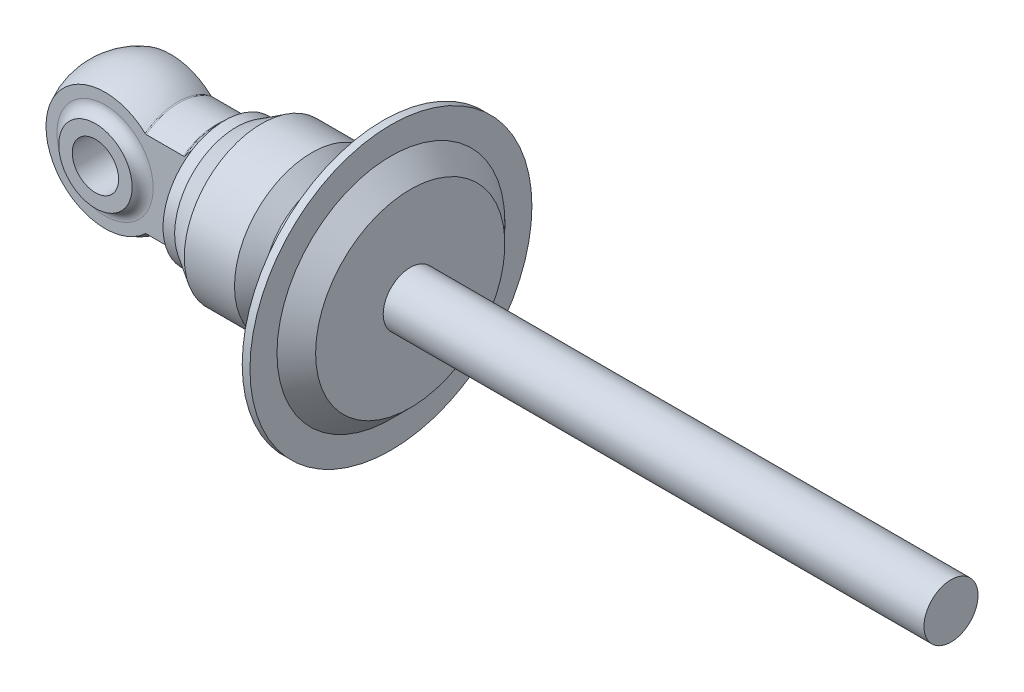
ISO-10303-21;
HEADER;
FILE_DESCRIPTION(('STEP AP214'),'2;1');
FILE_NAME('part.step','',(''),(''),'','','');
FILE_SCHEMA(('AUTOMOTIVE_DESIGN { 1 0 10303 214 1 1 1 1 }'));
ENDSEC;
DATA;
#1=APPLICATION_CONTEXT('core data for automotive mechanical design processes');
#2=APPLICATION_PROTOCOL_DEFINITION('international standard','automotive_design',2000,#1);
#3=PRODUCT_CONTEXT('',#1,'mechanical');
#4=PRODUCT('Part','Part','',(#3));
#5=PRODUCT_RELATED_PRODUCT_CATEGORY('part','',(#4));
#6=PRODUCT_DEFINITION_FORMATION('','',#4);
#7=PRODUCT_DEFINITION_CONTEXT('part definition',#1,'design');
#8=PRODUCT_DEFINITION('design','',#6,#7);
#9=PRODUCT_DEFINITION_SHAPE('','',#8);
#10=(LENGTH_UNIT() NAMED_UNIT(*) SI_UNIT(.MILLI.,.METRE.));
#11=(NAMED_UNIT(*) PLANE_ANGLE_UNIT() SI_UNIT($,.RADIAN.));
#12=(NAMED_UNIT(*) SI_UNIT($,.STERADIAN.) SOLID_ANGLE_UNIT());
#13=UNCERTAINTY_MEASURE_WITH_UNIT(LENGTH_MEASURE(1.E-05),#10,'distance_accuracy_value','');
#14=(GEOMETRIC_REPRESENTATION_CONTEXT(3) GLOBAL_UNCERTAINTY_ASSIGNED_CONTEXT((#13)) GLOBAL_UNIT_ASSIGNED_CONTEXT((#10,
#11,#12)) REPRESENTATION_CONTEXT('',''));
#15=CARTESIAN_POINT('',(0.,0.,0.));
#16=DIRECTION('',(0.,0.,1.));
#17=DIRECTION('',(1.,0.,0.));
#18=AXIS2_PLACEMENT_3D('',#15,#16,#17);
#19=CARTESIAN_POINT('',(0.,0.,11.));
#20=DIRECTION('',(0.,0.,-1.));
#21=DIRECTION('',(-1.,0.,0.));
#22=AXIS2_PLACEMENT_3D('',#19,#20,#21);
#23=CYLINDRICAL_SURFACE('',#22,6.00000000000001);
#24=CARTESIAN_POINT('',(0.,0.,11.));
#25=DIRECTION('',(0.,0.,-1.));
#26=DIRECTION('',(-1.,0.,0.));
#27=AXIS2_PLACEMENT_3D('',#24,#25,#26);
#28=CIRCLE('',#27,6.00000000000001);
#29=CARTESIAN_POINT('',(-6.00000000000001,0.,11.));
#30=VERTEX_POINT('',#29);
#31=EDGE_CURVE('E21',#30,#30,#28,.T.);
#32=ORIENTED_EDGE('',*,*,#31,.F.);
#33=EDGE_LOOP('',(#32));
#34=FACE_BOUND('',#33,.T.);
#35=CARTESIAN_POINT('',(0.,0.,-11.));
#36=DIRECTION('',(0.,0.,-1.));
#37=DIRECTION('',(-1.,0.,0.));
#38=AXIS2_PLACEMENT_3D('',#35,#36,#37);
#39=CIRCLE('',#38,6.00000000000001);
#40=CARTESIAN_POINT('',(-6.00000000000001,0.,-11.));
#41=VERTEX_POINT('',#40);
#42=EDGE_CURVE('E124',#41,#41,#39,.F.);
#43=ORIENTED_EDGE('',*,*,#42,.F.);
#44=EDGE_LOOP('',(#43));
#45=FACE_BOUND('',#44,.T.);
#46=ADVANCED_FACE('F16',(#34,#45),#23,.F.);
#47=CARTESIAN_POINT('',(22.5,43.8,11.));
#48=DIRECTION('',(0.,0.,1.));
#49=DIRECTION('',(1.,0.,0.));
#50=AXIS2_PLACEMENT_3D('',#47,#48,#49);
#51=PLANE('',#50);
#52=CARTESIAN_POINT('',(0.,0.,11.));
#53=DIRECTION('',(0.,0.,1.));
#54=DIRECTION('',(1.,0.,0.));
#55=AXIS2_PLACEMENT_3D('',#52,#53,#54);
#56=CIRCLE('',#55,9.50000000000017);
#57=CARTESIAN_POINT('',(9.50000000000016,0.,11.));
#58=VERTEX_POINT('',#57);
#59=EDGE_CURVE('E214',#58,#58,#56,.T.);
#60=ORIENTED_EDGE('',*,*,#59,.T.);
#61=EDGE_LOOP('',(#60));
#62=FACE_BOUND('',#61,.T.);
#63=ORIENTED_EDGE('',*,*,#31,.T.);
#64=EDGE_LOOP('',(#63));
#65=FACE_BOUND('',#64,.T.);
#66=ADVANCED_FACE('F449',(#62,#65),#51,.T.);
#67=CARTESIAN_POINT('',(-22.501,43.8,-11.));
#68=DIRECTION('',(0.,0.,-1.));
#69=DIRECTION('',(-1.,0.,0.));
#70=AXIS2_PLACEMENT_3D('',#67,#68,#69);
#71=PLANE('',#70);
#72=CARTESIAN_POINT('',(0.,0.,-11.));
#73=DIRECTION('',(0.,0.,-1.));
#74=DIRECTION('',(-1.,0.,0.));
#75=AXIS2_PLACEMENT_3D('',#72,#73,#74);
#76=CIRCLE('',#75,9.50000000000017);
#77=CARTESIAN_POINT('',(-9.50000000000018,5.96910883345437E-09,-11.));
#78=VERTEX_POINT('',#77);
#79=CARTESIAN_POINT('',(9.50000000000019,-6.2085702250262E-08,-11.));
#80=VERTEX_POINT('',#79);
#81=EDGE_CURVE('E421',#78,#80,#76,.T.);
#82=ORIENTED_EDGE('',*,*,#81,.T.);
#83=CARTESIAN_POINT('',(9.5000000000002,-5.5187284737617E-08,-11.));
#84=CARTESIAN_POINT('',(9.50002350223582,-0.254403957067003,-11.));
#85=CARTESIAN_POINT('',(9.48978177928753,-0.508804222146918,-11.));
#86=CARTESIAN_POINT('',(9.44893882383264,-1.01594556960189,-11.));
#87=CARTESIAN_POINT('',(9.41833918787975,-1.26868678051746,-11.));
#88=CARTESIAN_POINT('',(9.33696262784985,-1.77082860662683,-11.));
#89=CARTESIAN_POINT('',(9.28619132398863,-2.02023013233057,-11.));
#90=CARTESIAN_POINT('',(9.16480570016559,-2.51416164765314,-11.));
#91=CARTESIAN_POINT('',(9.09419074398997,-2.75869148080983,-11.));
#92=CARTESIAN_POINT('',(8.92953388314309,-3.25342238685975,-11.));
#93=CARTESIAN_POINT('',(8.83449389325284,-3.5032919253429,-11.));
#94=CARTESIAN_POINT('',(8.62369838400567,-3.9941424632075,-11.));
#95=CARTESIAN_POINT('',(8.50794204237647,-4.23512310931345,-11.));
#96=CARTESIAN_POINT('',(8.25655410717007,-4.70644659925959,-11.));
#97=CARTESIAN_POINT('',(8.12092501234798,-4.93679077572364,-11.));
#98=CARTESIAN_POINT('',(7.83074696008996,-5.38523234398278,-11.));
#99=CARTESIAN_POINT('',(7.67619822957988,-5.6033298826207,-11.));
#100=CARTESIAN_POINT('',(7.34927684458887,-6.02573279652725,-11.));
#101=CARTESIAN_POINT('',(7.17690404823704,-6.23003806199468,-11.));
#102=CARTESIAN_POINT('',(6.81556481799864,-6.62339786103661,-11.));
#103=CARTESIAN_POINT('',(6.62659874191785,-6.81245272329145,-11.));
#104=CARTESIAN_POINT('',(6.23338531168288,-7.17399822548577,-11.));
#105=CARTESIAN_POINT('',(6.02913581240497,-7.34648653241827,-11.));
#106=CARTESIAN_POINT('',(5.60683137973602,-7.67364221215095,-11.));
#107=CARTESIAN_POINT('',(5.38877645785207,-7.82830959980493,-11.));
#108=CARTESIAN_POINT('',(4.9404193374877,-8.11871878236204,-11.));
#109=CARTESIAN_POINT('',(4.71011756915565,-8.25446124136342,-11.));
#110=CARTESIAN_POINT('',(4.23889710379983,-8.50606191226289,-11.));
#111=CARTESIAN_POINT('',(3.99797840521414,-8.62192012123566,-11.));
#112=CARTESIAN_POINT('',(3.5072513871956,-8.83292235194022,-11.));
#113=CARTESIAN_POINT('',(3.25744358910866,-8.92806758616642,-11.));
#114=CARTESIAN_POINT('',(2.75070093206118,-9.09697608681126,-11.));
#115=CARTESIAN_POINT('',(2.49376607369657,-9.17073935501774,-11.));
#116=CARTESIAN_POINT('',(1.97459110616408,-9.29636069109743,-11.));
#117=CARTESIAN_POINT('',(1.7123509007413,-9.34821836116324,-11.));
#118=CARTESIAN_POINT('',(1.18443408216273,-9.42965789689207,-11.));
#119=CARTESIAN_POINT('',(0.918757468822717,-9.45923976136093,-11.));
#120=CARTESIAN_POINT('',(0.38585068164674,-9.49591778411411,-11.));
#121=CARTESIAN_POINT('',(0.118620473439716,-9.50301344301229,-11.));
#122=CARTESIAN_POINT('',(-0.415487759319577,-9.49466720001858,-11.));
#123=CARTESIAN_POINT('',(-0.68236578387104,-9.47922529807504,-11.));
#124=CARTESIAN_POINT('',(-1.21387000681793,-9.42591394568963,-11.));
#125=CARTESIAN_POINT('',(-1.47849622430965,-9.38804468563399,-11.));
#126=CARTESIAN_POINT('',(-2.00361778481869,-9.29014800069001,-11.));
#127=CARTESIAN_POINT('',(-2.26411312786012,-9.23012057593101,-11.));
#128=CARTESIAN_POINT('',(-2.77911961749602,-9.0883346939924,-11.));
#129=CARTESIAN_POINT('',(-3.03363079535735,-9.00657635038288,-11.));
#130=CARTESIAN_POINT('',(-3.53486093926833,-8.821909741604,-11.));
#131=CARTESIAN_POINT('',(-3.78157990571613,-8.71900147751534,-11.));
#132=CARTESIAN_POINT('',(-4.26547437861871,-8.49276535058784,-11.));
#133=CARTESIAN_POINT('',(-4.50264977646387,-8.3694372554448,-11.));
#134=CARTESIAN_POINT('',(-4.96577280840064,-8.10323629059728,-11.));
#135=CARTESIAN_POINT('',(-5.19172020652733,-7.96036301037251,-11.));
#136=CARTESIAN_POINT('',(-5.63076487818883,-7.65609678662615,-11.));
#137=CARTESIAN_POINT('',(-5.84386276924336,-7.49470473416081,-11.));
#138=CARTESIAN_POINT('',(-6.2557049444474,-7.1545430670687,-11.));
#139=CARTESIAN_POINT('',(-6.45444925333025,-6.97577348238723,-11.));
#140=CARTESIAN_POINT('',(-6.83614948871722,-6.60214922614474,-11.));
#141=CARTESIAN_POINT('',(-7.01910725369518,-6.40729643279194,-11.));
#142=CARTESIAN_POINT('',(-7.36796001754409,-6.00287259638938,-11.));
#143=CARTESIAN_POINT('',(-7.53385501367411,-5.7933015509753,-11.));
#144=CARTESIAN_POINT('',(-7.8474481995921,-5.36086858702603,-11.));
#145=CARTESIAN_POINT('',(-7.99514114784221,-5.13800286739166,-11.));
#146=CARTESIAN_POINT('',(-8.27122042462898,-4.68062642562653,-11.));
#147=CARTESIAN_POINT('',(-8.39960729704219,-4.44611603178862,-11.));
#148=CARTESIAN_POINT('',(-8.63623449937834,-3.96697461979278,-11.));
#149=CARTESIAN_POINT('',(-8.74446319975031,-3.72233785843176,-11.));
#150=CARTESIAN_POINT('',(-8.93990981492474,-3.2248163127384,-11.));
#151=CARTESIAN_POINT('',(-9.02712826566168,-2.97193173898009,-11.));
#152=CARTESIAN_POINT('',(-9.1798502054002,-2.46000484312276,-11.));
#153=CARTESIAN_POINT('',(-9.24537809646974,-2.20096979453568,-11.));
#154=CARTESIAN_POINT('',(-9.35436588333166,-1.67840179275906,-11.));
#155=CARTESIAN_POINT('',(-9.39783581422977,-1.41487094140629,-11.));
#156=CARTESIAN_POINT('',(-9.45341796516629,-0.959107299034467,-11.));
#157=CARTESIAN_POINT('',(-9.47089671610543,-0.76751159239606,-11.));
#158=CARTESIAN_POINT('',(-9.49418007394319,-0.383949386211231,-11.));
#159=CARTESIAN_POINT('',(-9.50000509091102,-0.191984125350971,-11.));
#160=CARTESIAN_POINT('',(-9.5000000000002,1.19382169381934E-08,-11.));
#161=B_SPLINE_CURVE_WITH_KNOTS('',3,(#83,#84,#85,#86,#87,#88,#89,#90,#91,#92,#93,#94,#95,#96,
#97,#98,#99,#100,#101,#102,#103,#104,#105,#106,#107,#108,#109,#110,#111,#112,#113,#114,#115,
#116,#117,#118,#119,#120,#121,#122,#123,#124,#125,#126,#127,#128,#129,#130,#131,#132,#133,#134,
#135,#136,#137,#138,#139,#140,#141,#142,#143,#144,#145,#146,#147,#148,#149,#150,#151,#152,#153,
#154,#155,#156,#157,#158,#159,#160),.UNSPECIFIED.,.F.,.F.,(4,2,2,2,2,2,2,2,2,2,2,2,2,2,2,2,2,2,
2,2,2,2,2,2,2,2,2,2,2,2,2,2,2,2,2,2,2,2,4),(0.,0.763000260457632,1.52594069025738,
2.28866869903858,3.05142116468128,3.85246403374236,4.6535387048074,5.45451273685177,
6.25547716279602,7.05644796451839,7.85740149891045,8.65846766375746,9.45953316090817,
10.2605705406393,11.0616080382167,11.8625986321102,12.66358915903,13.4645942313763,
14.2655993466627,15.0666222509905,15.8676451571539,16.6686612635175,17.4696773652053,
18.2706892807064,19.0717011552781,19.8727221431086,20.6737599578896,21.4747592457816,
22.2757571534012,23.0766616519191,23.8775662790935,24.6787010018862,25.4798131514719,
26.281386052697,27.0829385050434,27.88358611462,28.6838691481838,29.2607070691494,
29.8365338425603),.UNSPECIFIED.);
#162=EDGE_CURVE('E427',#80,#78,#161,.T.);
#163=ORIENTED_EDGE('',*,*,#162,.T.);
#164=EDGE_LOOP('',(#82,#163));
#165=FACE_BOUND('',#164,.T.);
#166=ORIENTED_EDGE('',*,*,#42,.T.);
#167=EDGE_LOOP('',(#166));
#168=FACE_BOUND('',#167,.T.);
#169=ADVANCED_FACE('F445',(#165,#168),#71,.T.);
#170=CARTESIAN_POINT('',(10.6653645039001,0.,0.));
#171=DIRECTION('',(-1.,0.,0.));
#172=DIRECTION('',(0.,-1.,0.));
#173=AXIS2_PLACEMENT_3D('',#170,#171,#172);
#174=TOROIDAL_SURFACE('',#173,14.5,0.500000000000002);
#175=CARTESIAN_POINT('',(10.6653645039,0.,0.));
#176=DIRECTION('',(-1.,0.,0.));
#177=DIRECTION('',(0.,0.,1.));
#178=AXIS2_PLACEMENT_3D('',#175,#176,#177);
#179=CIRCLE('',#178,14.);
#180=CARTESIAN_POINT('',(10.6653645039,-11.1242977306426,8.5));
#181=VERTEX_POINT('',#180);
#182=CARTESIAN_POINT('',(10.6653645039,-11.1242977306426,-8.5));
#183=VERTEX_POINT('',#182);
#184=EDGE_CURVE('E127',#181,#183,#179,.F.);
#185=ORIENTED_EDGE('',*,*,#184,.F.);
#186=CARTESIAN_POINT('',(10.3691043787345,-11.2464071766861,8.49999999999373));
#187=CARTESIAN_POINT('',(10.3876905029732,-11.2292395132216,8.49999999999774));
#188=CARTESIAN_POINT('',(10.407586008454,-11.2134019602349,8.49999999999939));
#189=CARTESIAN_POINT('',(10.4497643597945,-11.1849481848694,8.50000000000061));
#190=CARTESIAN_POINT('',(10.4720636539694,-11.1723564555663,8.50000000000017));
#191=CARTESIAN_POINT('',(10.5186504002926,-11.1511743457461,8.49999999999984));
#192=CARTESIAN_POINT('',(10.5429472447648,-11.1426043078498,8.49999999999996));
#193=CARTESIAN_POINT('',(10.5926175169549,-11.130186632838,8.50000000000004));
#194=CARTESIAN_POINT('',(10.6179846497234,-11.1263145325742,8.50000000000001));
#195=CARTESIAN_POINT('',(10.6507506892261,-11.1244975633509,8.5));
#196=CARTESIAN_POINT('',(10.658059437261,-11.1242949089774,8.5));
#197=CARTESIAN_POINT('',(10.6653645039,-11.1242977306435,8.5));
#198=B_SPLINE_CURVE_WITH_KNOTS('',3,(#186,#187,#188,#189,#190,#191,#192,#193,#194,#195,#196,
#197),.UNSPECIFIED.,.F.,.F.,(4,2,2,2,2,4),(0.,0.0759306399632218,0.152418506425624,
0.229289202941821,0.305757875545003,0.327680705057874),.UNSPECIFIED.);
#199=CARTESIAN_POINT('',(10.3691043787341,-11.2464071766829,8.4999999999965));
#200=VERTEX_POINT('',#199);
#201=EDGE_CURVE('E112',#200,#181,#198,.T.);
#202=ORIENTED_EDGE('',*,*,#201,.F.);
#203=CARTESIAN_POINT('',(10.3691043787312,0.,0.));
#204=DIRECTION('',(-1.,0.,0.));
#205=DIRECTION('',(0.,-1.,0.));
#206=AXIS2_PLACEMENT_3D('',#203,#204,#205);
#207=CIRCLE('',#206,14.0972222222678);
#208=CARTESIAN_POINT('',(10.3691043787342,-11.2464071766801,-8.5));
#209=VERTEX_POINT('',#208);
#210=EDGE_CURVE('E132',#209,#200,#207,.T.);
#211=ORIENTED_EDGE('',*,*,#210,.F.);
#212=CARTESIAN_POINT('',(10.6653645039,-11.1242977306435,-8.5));
#213=CARTESIAN_POINT('',(10.6412641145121,-11.1242514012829,-8.5));
#214=CARTESIAN_POINT('',(10.6172053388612,-11.1264872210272,-8.5));
#215=CARTESIAN_POINT('',(10.5699730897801,-11.1351411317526,-8.5));
#216=CARTESIAN_POINT('',(10.5467957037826,-11.1415376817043,-8.5));
#217=CARTESIAN_POINT('',(10.5019037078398,-11.1581243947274,-8.5));
#218=CARTESIAN_POINT('',(10.4801867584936,-11.1683083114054,-8.5));
#219=CARTESIAN_POINT('',(10.4386085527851,-11.1919222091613,-8.5));
#220=CARTESIAN_POINT('',(10.4187475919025,-11.2053527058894,-8.5));
#221=CARTESIAN_POINT('',(10.3893203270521,-11.2284718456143,-8.5));
#222=CARTESIAN_POINT('',(10.3790297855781,-11.2372516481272,-8.5));
#223=CARTESIAN_POINT('',(10.3691043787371,-11.2464071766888,-8.5));
#224=B_SPLINE_CURVE_WITH_KNOTS('',3,(#212,#213,#214,#215,#216,#217,#218,#219,#220,#221,#222,
#223),.UNSPECIFIED.,.F.,.F.,(4,2,2,2,2,4),(0.,0.0721320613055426,0.14389361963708,
0.215537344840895,0.287192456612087,0.327721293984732),.UNSPECIFIED.);
#225=EDGE_CURVE('E123',#183,#209,#224,.T.);
#226=ORIENTED_EDGE('',*,*,#225,.F.);
#227=EDGE_LOOP('',(#185,#202,#211,#226));
#228=FACE_BOUND('',#227,.T.);
#229=ADVANCED_FACE('F128',(#228),#174,.F.);
#230=CARTESIAN_POINT('',(10.6653645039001,0.,0.));
#231=DIRECTION('',(-1.,0.,0.));
#232=DIRECTION('',(0.,-1.,0.));
#233=AXIS2_PLACEMENT_3D('',#230,#231,#232);
#234=TOROIDAL_SURFACE('',#233,14.5,0.500000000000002);
#235=CARTESIAN_POINT('',(10.3691043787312,0.,0.));
#236=DIRECTION('',(-1.,0.,0.));
#237=DIRECTION('',(0.,-1.,0.));
#238=AXIS2_PLACEMENT_3D('',#235,#236,#237);
#239=CIRCLE('',#238,14.0972222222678);
#240=CARTESIAN_POINT('',(10.3691043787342,11.2464071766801,8.5));
#241=VERTEX_POINT('',#240);
#242=CARTESIAN_POINT('',(10.3691043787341,11.2464071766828,-8.49999999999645));
#243=VERTEX_POINT('',#242);
#244=EDGE_CURVE('E420',#241,#243,#239,.T.);
#245=ORIENTED_EDGE('',*,*,#244,.F.);
#246=CARTESIAN_POINT('',(10.6653645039,11.1242977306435,8.5));
#247=CARTESIAN_POINT('',(10.6412641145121,11.1242514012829,8.5));
#248=CARTESIAN_POINT('',(10.6172053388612,11.1264872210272,8.5));
#249=CARTESIAN_POINT('',(10.5699730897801,11.1351411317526,8.5));
#250=CARTESIAN_POINT('',(10.5467957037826,11.1415376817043,8.5));
#251=CARTESIAN_POINT('',(10.5019037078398,11.1581243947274,8.5));
#252=CARTESIAN_POINT('',(10.4801867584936,11.1683083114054,8.5));
#253=CARTESIAN_POINT('',(10.4386085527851,11.1919222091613,8.5));
#254=CARTESIAN_POINT('',(10.4187475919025,11.2053527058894,8.5));
#255=CARTESIAN_POINT('',(10.3893203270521,11.2284718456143,8.5));
#256=CARTESIAN_POINT('',(10.3790297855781,11.2372516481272,8.5));
#257=CARTESIAN_POINT('',(10.369104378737,11.2464071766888,8.5));
#258=B_SPLINE_CURVE_WITH_KNOTS('',3,(#246,#247,#248,#249,#250,#251,#252,#253,#254,#255,#256,
#257),.UNSPECIFIED.,.F.,.F.,(4,2,2,2,2,4),(0.,0.0721320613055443,0.143893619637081,
0.215537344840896,0.287192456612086,0.327721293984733),.UNSPECIFIED.);
#259=CARTESIAN_POINT('',(10.6653645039,11.1242977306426,8.5));
#260=VERTEX_POINT('',#259);
#261=EDGE_CURVE('E215',#260,#241,#258,.T.);
#262=ORIENTED_EDGE('',*,*,#261,.F.);
#263=CARTESIAN_POINT('',(10.6653645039,0.,0.));
#264=DIRECTION('',(-1.,0.,0.));
#265=DIRECTION('',(0.,0.,1.));
#266=AXIS2_PLACEMENT_3D('',#263,#264,#265);
#267=CIRCLE('',#266,14.);
#268=CARTESIAN_POINT('',(10.6653645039,11.1242977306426,-8.5));
#269=VERTEX_POINT('',#268);
#270=EDGE_CURVE('E131',#269,#260,#267,.F.);
#271=ORIENTED_EDGE('',*,*,#270,.F.);
#272=CARTESIAN_POINT('',(10.3691043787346,11.2464071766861,-8.49999999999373));
#273=CARTESIAN_POINT('',(10.3876905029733,11.2292395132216,-8.49999999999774));
#274=CARTESIAN_POINT('',(10.407586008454,11.2134019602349,-8.49999999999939));
#275=CARTESIAN_POINT('',(10.4497643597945,11.1849481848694,-8.50000000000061));
#276=CARTESIAN_POINT('',(10.4720636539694,11.1723564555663,-8.50000000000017));
#277=CARTESIAN_POINT('',(10.5186504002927,11.1511743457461,-8.49999999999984));
#278=CARTESIAN_POINT('',(10.5429472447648,11.1426043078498,-8.49999999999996));
#279=CARTESIAN_POINT('',(10.5926175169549,11.130186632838,-8.50000000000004));
#280=CARTESIAN_POINT('',(10.6179846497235,11.1263145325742,-8.50000000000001));
#281=CARTESIAN_POINT('',(10.6507506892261,11.1244975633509,-8.5));
#282=CARTESIAN_POINT('',(10.658059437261,11.1242949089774,-8.5));
#283=CARTESIAN_POINT('',(10.6653645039,11.1242977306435,-8.5));
#284=B_SPLINE_CURVE_WITH_KNOTS('',3,(#272,#273,#274,#275,#276,#277,#278,#279,#280,#281,#282,
#283),.UNSPECIFIED.,.F.,.F.,(4,2,2,2,2,4),(0.,0.0759306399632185,0.152418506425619,
0.229289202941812,0.305757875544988,0.327680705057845),.UNSPECIFIED.);
#285=EDGE_CURVE('E207',#243,#269,#284,.T.);
#286=ORIENTED_EDGE('',*,*,#285,.F.);
#287=EDGE_LOOP('',(#245,#262,#271,#286));
#288=FACE_BOUND('',#287,.T.);
#289=ADVANCED_FACE('F220',(#288),#234,.F.);
#290=CARTESIAN_POINT('',(0.,0.,11.5000000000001));
#291=DIRECTION('',(0.,0.,1.));
#292=DIRECTION('',(1.,0.,0.));
#293=AXIS2_PLACEMENT_3D('',#290,#291,#292);
#294=TOROIDAL_SURFACE('',#293,12.45803989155,3.00000000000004);
#295=ORIENTED_EDGE('',*,*,#59,.F.);
#296=EDGE_LOOP('',(#295));
#297=FACE_BOUND('',#296,.T.);
#298=CARTESIAN_POINT('',(-12.458029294,-3.13108077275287E-08,8.50000000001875));
#299=CARTESIAN_POINT('',(-12.4580232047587,-0.112326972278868,8.49999999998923));
#300=CARTESIAN_POINT('',(-12.4565110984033,-0.224654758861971,8.49999999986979));
#301=CARTESIAN_POINT('',(-12.450472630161,-0.449229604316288,8.5000000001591));
#302=CARTESIAN_POINT('',(-12.4459462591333,-0.561476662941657,8.50000000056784));
#303=CARTESIAN_POINT('',(-12.4338769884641,-0.785807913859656,8.50000000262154));
#304=CARTESIAN_POINT('',(-12.4263340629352,-0.897892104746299,8.50000000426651));
#305=CARTESIAN_POINT('',(-12.4064552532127,-1.14421884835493,8.50000001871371));
#306=CARTESIAN_POINT('',(-12.393462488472,-1.27840963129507,8.50000003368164));
#307=CARTESIAN_POINT('',(-12.372670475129,-1.46160224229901,8.5000000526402));
#308=CARTESIAN_POINT('',(-12.3667808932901,-1.51082682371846,8.50000005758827));
#309=CARTESIAN_POINT('',(-12.3495377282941,-1.64776012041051,8.50000006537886));
#310=CARTESIAN_POINT('',(-12.3375202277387,-1.73538633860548,8.50000006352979));
#311=CARTESIAN_POINT('',(-12.3073008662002,-1.93945422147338,8.50000005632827));
#312=CARTESIAN_POINT('',(-12.288371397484,-2.05578805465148,8.50000005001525));
#313=CARTESIAN_POINT('',(-12.2420644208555,-2.31683079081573,8.50000003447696));
#314=CARTESIAN_POINT('',(-12.2137575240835,-2.46137648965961,8.50000002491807));
#315=CARTESIAN_POINT('',(-12.1688175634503,-2.67101497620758,8.50000001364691));
#316=CARTESIAN_POINT('',(-12.1542121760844,-2.73654894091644,8.50000001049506));
#317=CARTESIAN_POINT('',(-12.1274190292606,-2.85236290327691,8.50000000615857));
#318=CARTESIAN_POINT('',(-12.115445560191,-2.9026924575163,8.50000000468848));
#319=CARTESIAN_POINT('',(-12.0805125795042,-3.04560308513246,8.50000000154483));
#320=CARTESIAN_POINT('',(-12.0568077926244,-3.13800301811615,8.5000000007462));
#321=CARTESIAN_POINT('',(-12.0043188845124,-3.33329766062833,8.49999999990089));
#322=CARTESIAN_POINT('',(-11.9752666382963,-3.43612030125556,8.49999999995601));
#323=CARTESIAN_POINT('',(-11.9112805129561,-3.65196899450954,8.50000000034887));
#324=CARTESIAN_POINT('',(-11.876049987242,-3.76490720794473,8.50000000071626));
#325=CARTESIAN_POINT('',(-11.7988287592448,-4.00062213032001,8.50000000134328));
#326=CARTESIAN_POINT('',(-11.7565137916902,-4.12329268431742,8.50000000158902));
#327=CARTESIAN_POINT('',(-11.6641762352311,-4.37802383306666,8.5000000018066));
#328=CARTESIAN_POINT('',(-11.6138029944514,-4.50995742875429,8.50000000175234));
#329=CARTESIAN_POINT('',(-11.5043407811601,-4.78266863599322,8.50000000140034));
#330=CARTESIAN_POINT('',(-11.444876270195,-4.92329555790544,8.5000000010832));
#331=CARTESIAN_POINT('',(-11.316169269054,-5.21274094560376,8.50000000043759));
#332=CARTESIAN_POINT('',(-11.2465278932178,-5.36138237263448,8.50000000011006));
#333=CARTESIAN_POINT('',(-11.1123006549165,-5.63375281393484,8.49999999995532));
#334=CARTESIAN_POINT('',(-11.0485190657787,-5.75787963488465,8.50000000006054));
#335=CARTESIAN_POINT('',(-10.8931884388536,-6.04806954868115,8.50000000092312));
#336=CARTESIAN_POINT('',(-10.799887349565,-6.21320005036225,8.50000000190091));
#337=CARTESIAN_POINT('',(-10.622256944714,-6.51145431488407,8.50000000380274));
#338=CARTESIAN_POINT('',(-10.539079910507,-6.64526697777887,8.5000000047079));
#339=CARTESIAN_POINT('',(-10.3679415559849,-6.90927595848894,8.50000000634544));
#340=CARTESIAN_POINT('',(-10.2799940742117,-7.03948123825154,8.5000000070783));
#341=CARTESIAN_POINT('',(-10.0994835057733,-7.29611250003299,8.50000000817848));
#342=CARTESIAN_POINT('',(-10.0069338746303,-7.42254794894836,8.50000000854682));
#343=CARTESIAN_POINT('',(-9.81739088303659,-7.67148842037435,8.50000000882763));
#344=CARTESIAN_POINT('',(-9.72041058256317,-7.79400338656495,8.50000000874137));
#345=CARTESIAN_POINT('',(-9.52218308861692,-8.03495945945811,8.50000000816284));
#346=CARTESIAN_POINT('',(-9.42094854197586,-8.15341096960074,8.50000000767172));
#347=CARTESIAN_POINT('',(-9.21439247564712,-8.38610200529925,8.50000000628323));
#348=CARTESIAN_POINT('',(-9.10908317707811,-8.50035238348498,8.500000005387));
#349=CARTESIAN_POINT('',(-8.88128599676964,-8.73839798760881,8.50000000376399));
#350=CARTESIAN_POINT('',(-8.75825980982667,-8.86167873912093,8.50000000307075));
#351=CARTESIAN_POINT('',(-8.50715578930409,-9.10298072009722,8.50000000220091));
#352=CARTESIAN_POINT('',(-8.3790779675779,-9.22100196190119,8.5000000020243));
#353=CARTESIAN_POINT('',(-8.11809174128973,-9.45157794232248,8.50000000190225));
#354=CARTESIAN_POINT('',(-7.98518333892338,-9.56413268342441,8.50000000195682));
#355=CARTESIAN_POINT('',(-7.7147717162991,-9.78357751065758,8.50000000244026));
#356=CARTESIAN_POINT('',(-7.57726848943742,-9.89046758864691,8.50000000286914));
#357=CARTESIAN_POINT('',(-7.29790003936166,-10.0983997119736,8.50000000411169));
#358=CARTESIAN_POINT('',(-7.15603480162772,-10.1994417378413,8.50000000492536));
#359=CARTESIAN_POINT('',(-6.95456153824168,-10.3366748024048,8.50000000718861));
#360=CARTESIAN_POINT('',(-6.89666839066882,-10.3754027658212,8.50000000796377));
#361=CARTESIAN_POINT('',(-6.74816031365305,-10.4729528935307,8.50000000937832));
#362=CARTESIAN_POINT('',(-6.65709362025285,-10.5310880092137,8.50000000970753));
#363=CARTESIAN_POINT('',(-6.38161985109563,-10.7018270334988,8.50000000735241));
#364=CARTESIAN_POINT('',(-6.19492216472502,-10.8107763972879,8.50000000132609));
#365=CARTESIAN_POINT('',(-5.93378131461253,-10.9544233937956,8.49999999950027));
#366=CARTESIAN_POINT('',(-5.86156539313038,-10.9932471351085,8.49999999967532));
#367=CARTESIAN_POINT('',(-5.55983411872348,-11.151659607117,8.50000000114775));
#368=CARTESIAN_POINT('',(-5.32690898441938,-11.2648871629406,8.50000000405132));
#369=CARTESIAN_POINT('',(-4.93453151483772,-11.4406727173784,8.50000001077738));
#370=CARTESIAN_POINT('',(-4.77692031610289,-11.5074015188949,8.50000001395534));
#371=CARTESIAN_POINT('',(-4.43788936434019,-11.6427252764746,8.50000001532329));
#372=CARTESIAN_POINT('',(-4.2560939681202,-11.7103855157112,8.50000001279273));
#373=CARTESIAN_POINT('',(-3.93169815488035,-11.8225092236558,8.50000000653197));
#374=CARTESIAN_POINT('',(-3.7897019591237,-11.8687283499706,8.50000000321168));
#375=CARTESIAN_POINT('',(-3.63279286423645,-11.9167332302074,8.50000000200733));
#376=CARTESIAN_POINT('',(-3.61863959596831,-11.9210360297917,8.50000000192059));
#377=CARTESIAN_POINT('',(-3.49367156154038,-11.9587902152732,8.50000000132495));
#378=CARTESIAN_POINT('',(-3.3824038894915,-11.9907555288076,8.50000000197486));
#379=CARTESIAN_POINT('',(-3.06038876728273,-12.0784182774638,8.50000000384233));
#380=CARTESIAN_POINT('',(-2.84855173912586,-12.1301492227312,8.50000000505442));
#381=CARTESIAN_POINT('',(-2.37585593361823,-12.2325371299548,8.50000001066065));
#382=CARTESIAN_POINT('',(-2.1144067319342,-12.2804857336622,8.50000001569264));
#383=CARTESIAN_POINT('',(-1.62803276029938,-12.3536473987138,8.50000002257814));
#384=CARTESIAN_POINT('',(-1.40345371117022,-12.3811801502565,8.50000002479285));
#385=CARTESIAN_POINT('',(-0.982497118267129,-12.4211535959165,8.50000002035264));
#386=CARTESIAN_POINT('',(-0.786261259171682,-12.4350942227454,8.50000001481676));
#387=CARTESIAN_POINT('',(-0.393346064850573,-12.4535372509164,8.50000000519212));
#388=CARTESIAN_POINT('',(-0.196666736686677,-12.4580398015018,8.50000000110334));
#389=CARTESIAN_POINT('',(0.13666379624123,-12.4580219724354,8.49999999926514));
#390=CARTESIAN_POINT('',(0.273321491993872,-12.4558353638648,8.49999999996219));
#391=CARTESIAN_POINT('',(0.568655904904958,-12.4462248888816,8.50000000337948));
#392=CARTESIAN_POINT('',(0.72730856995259,-12.4380090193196,8.50000000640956));
#393=CARTESIAN_POINT('',(0.988858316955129,-12.4194431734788,8.50000001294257));
#394=CARTESIAN_POINT('',(1.0918837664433,-12.4108395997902,8.50000001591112));
#395=CARTESIAN_POINT('',(1.29247720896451,-12.3915529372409,8.50000002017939));
#396=CARTESIAN_POINT('',(1.39005734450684,-12.3809972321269,8.50000002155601));
#397=CARTESIAN_POINT('',(1.57973717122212,-12.3581891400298,8.50000002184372));
#398=CARTESIAN_POINT('',(1.67185150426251,-12.3460573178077,8.50000002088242));
#399=CARTESIAN_POINT('',(1.93941739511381,-12.3077583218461,8.50000001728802));
#400=CARTESIAN_POINT('',(2.1144870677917,-12.2788595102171,8.50000001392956));
#401=CARTESIAN_POINT('',(2.43190492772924,-12.2194803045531,8.50000000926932));
#402=CARTESIAN_POINT('',(2.57448291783,-12.190216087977,8.50000000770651));
#403=CARTESIAN_POINT('',(2.82743228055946,-12.1336604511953,8.50000000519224));
#404=CARTESIAN_POINT('',(2.93802102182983,-12.1073397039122,8.50000000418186));
#405=CARTESIAN_POINT('',(3.12754532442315,-12.059484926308,8.50000000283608));
#406=CARTESIAN_POINT('',(3.20666464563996,-12.0386771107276,8.50000000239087));
#407=CARTESIAN_POINT('',(3.35118436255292,-11.9991384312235,8.50000000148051));
#408=CARTESIAN_POINT('',(3.41665097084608,-11.9806480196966,8.50000000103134));
#409=CARTESIAN_POINT('',(3.69132056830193,-11.9006845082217,8.50000000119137));
#410=CARTESIAN_POINT('',(3.8991371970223,-11.8343420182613,8.50000000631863));
#411=CARTESIAN_POINT('',(4.28495386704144,-11.699807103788,8.50000001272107));
#412=CARTESIAN_POINT('',(4.46340659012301,-11.6329050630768,8.50000001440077));
#413=CARTESIAN_POINT('',(4.79148936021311,-11.5012012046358,8.50000001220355));
#414=CARTESIAN_POINT('',(4.94155880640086,-11.4374923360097,8.50000000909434));
#415=CARTESIAN_POINT('',(5.25222713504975,-11.2983322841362,8.5000000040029));
#416=CARTESIAN_POINT('',(5.41258435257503,-11.2223409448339,8.50000000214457));
#417=CARTESIAN_POINT('',(5.73732631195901,-11.0599202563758,8.50000000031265));
#418=CARTESIAN_POINT('',(5.9015502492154,-10.9731694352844,8.50000000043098));
#419=CARTESIAN_POINT('',(6.23320501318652,-10.788416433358,8.50000000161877));
#420=CARTESIAN_POINT('',(6.40045272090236,-10.6900851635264,8.50000000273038));
#421=CARTESIAN_POINT('',(6.7163192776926,-10.4943135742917,8.50000000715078));
#422=CARTESIAN_POINT('',(6.86532256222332,-10.3974927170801,8.50000001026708));
#423=CARTESIAN_POINT('',(7.15903630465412,-10.1975403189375,8.50000001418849));
#424=CARTESIAN_POINT('',(7.30374674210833,-10.094408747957,8.50000001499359));
#425=CARTESIAN_POINT('',(7.58860873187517,-9.88203444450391,8.50000001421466));
#426=CARTESIAN_POINT('',(7.72876028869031,-9.77279171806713,8.50000001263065));
#427=CARTESIAN_POINT('',(8.00425292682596,-9.5483928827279,8.50000000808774));
#428=CARTESIAN_POINT('',(8.13959404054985,-9.43323681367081,8.50000000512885));
#429=CARTESIAN_POINT('',(8.33879206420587,-9.25622854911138,8.50000000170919));
#430=CARTESIAN_POINT('',(8.40455735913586,-9.19651192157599,8.50000000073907));
#431=CARTESIAN_POINT('',(8.49415827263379,-9.11339725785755,8.50000000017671));
#432=CARTESIAN_POINT('',(8.51854588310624,-9.09059311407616,8.50000000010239));
#433=CARTESIAN_POINT('',(8.61847319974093,-8.99640714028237,8.4999999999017));
#434=CARTESIAN_POINT('',(8.69322399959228,-8.92418506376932,8.49999999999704));
#435=CARTESIAN_POINT('',(8.8760915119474,-8.74303043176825,8.500000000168));
#436=CARTESIAN_POINT('',(8.98313013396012,-8.63300742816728,8.50000000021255));
#437=CARTESIAN_POINT('',(9.22695500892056,-8.37294832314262,8.50000000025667));
#438=CARTESIAN_POINT('',(9.36219260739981,-8.22145862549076,8.50000000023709));
#439=CARTESIAN_POINT('',(9.65719326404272,-7.87428883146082,8.50000000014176));
#440=CARTESIAN_POINT('',(9.81489061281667,-7.67684423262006,8.50000000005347));
#441=CARTESIAN_POINT('',(10.0517887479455,-7.36100679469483,8.4999999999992));
#442=CARTESIAN_POINT('',(10.1351976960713,-7.24574186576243,8.49999999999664));
#443=CARTESIAN_POINT('',(10.2980211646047,-7.01241741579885,8.50000000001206));
#444=CARTESIAN_POINT('',(10.3774356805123,-6.89435789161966,8.50000000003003));
#445=CARTESIAN_POINT('',(10.5321727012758,-6.65558863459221,8.50000000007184));
#446=CARTESIAN_POINT('',(10.6074952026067,-6.53487889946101,8.50000000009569));
#447=CARTESIAN_POINT('',(10.753960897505,-6.29094942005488,8.50000000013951));
#448=CARTESIAN_POINT('',(10.8251040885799,-6.16772967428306,8.50000000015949));
#449=CARTESIAN_POINT('',(10.9631272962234,-5.91892528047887,8.50000000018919));
#450=CARTESIAN_POINT('',(11.0300073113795,-5.79334063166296,8.50000000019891));
#451=CARTESIAN_POINT('',(11.1594257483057,-5.53995378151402,8.50000000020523));
#452=CARTESIAN_POINT('',(11.2219641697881,-5.41215158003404,8.50000000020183));
#453=CARTESIAN_POINT('',(11.342625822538,-5.15447976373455,8.50000000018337));
#454=CARTESIAN_POINT('',(11.4007490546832,-5.02461014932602,8.50000000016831));
#455=CARTESIAN_POINT('',(11.5125125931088,-4.76295587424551,8.50000000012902));
#456=CARTESIAN_POINT('',(11.5661529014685,-4.63117121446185,8.50000000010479));
#457=CARTESIAN_POINT('',(11.6688857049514,-4.36584208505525,8.50000000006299));
#458=CARTESIAN_POINT('',(11.7179782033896,-4.23229761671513,8.50000000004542));
#459=CARTESIAN_POINT('',(11.8115648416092,-3.96360389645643,8.50000000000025));
#460=CARTESIAN_POINT('',(11.8560589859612,-3.8284546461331,8.49999999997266));
#461=CARTESIAN_POINT('',(11.919293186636,-3.62464867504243,8.50000000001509));
#462=CARTESIAN_POINT('',(11.9397870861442,-3.55653177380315,8.50000000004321));
#463=CARTESIAN_POINT('',(11.967580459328,-3.46126409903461,8.50000000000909));
#464=CARTESIAN_POINT('',(11.9753633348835,-3.43425396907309,8.49999999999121));
#465=CARTESIAN_POINT('',(12.0093154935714,-3.31493969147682,8.50000000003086));
#466=CARTESIAN_POINT('',(12.0345308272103,-3.22236306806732,8.50000000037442));
#467=CARTESIAN_POINT('',(12.101773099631,-2.96376809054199,8.50000000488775));
#468=CARTESIAN_POINT('',(12.1414626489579,-2.79713395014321,8.50000001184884));
#469=CARTESIAN_POINT('',(12.2005079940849,-2.52438090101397,8.50000002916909));
#470=CARTESIAN_POINT('',(12.221950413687,-2.4187069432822,8.50000003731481));
#471=CARTESIAN_POINT('',(12.262683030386,-2.20356661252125,8.50000005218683));
#472=CARTESIAN_POINT('',(12.2818865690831,-2.09408370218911,8.50000005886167));
#473=CARTESIAN_POINT('',(12.3115483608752,-1.91042259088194,8.50000006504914));
#474=CARTESIAN_POINT('',(12.3228163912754,-1.83637342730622,8.50000006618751));
#475=CARTESIAN_POINT('',(12.3532597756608,-1.62331030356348,8.50000006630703));
#476=CARTESIAN_POINT('',(12.3707445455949,-1.48404981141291,8.50000006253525));
#477=CARTESIAN_POINT('',(12.3979564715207,-1.23292568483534,8.50000005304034));
#478=CARTESIAN_POINT('',(12.4085357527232,-1.1211528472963,8.50000004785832));
#479=CARTESIAN_POINT('',(12.4266543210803,-0.897360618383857,8.50000003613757));
#480=CARTESIAN_POINT('',(12.4341936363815,-0.785341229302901,8.50000002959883));
#481=CARTESIAN_POINT('',(12.4462271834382,-0.561140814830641,8.50000001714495));
#482=CARTESIAN_POINT('',(12.4507214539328,-0.448959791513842,8.50000001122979));
#483=CARTESIAN_POINT('',(12.4566620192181,-0.22451889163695,8.50000000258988));
#484=CARTESIAN_POINT('',(12.4581083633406,-0.112259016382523,8.49999999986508));
#485=CARTESIAN_POINT('',(12.458029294,0.,8.50000000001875));
#486=B_SPLINE_CURVE_WITH_KNOTS('',3,(#298,#299,#300,#301,#302,#303,#304,#305,#306,#307,#308,
#309,#310,#311,#312,#313,#314,#315,#316,#317,#318,#319,#320,#321,#322,#323,#324,#325,#326,#327,
#328,#329,#330,#331,#332,#333,#334,#335,#336,#337,#338,#339,#340,#341,#342,#343,#344,#345,#346,
#347,#348,#349,#350,#351,#352,#353,#354,#355,#356,#357,#358,#359,#360,#361,#362,#363,#364,#365,
#366,#367,#368,#369,#370,#371,#372,#373,#374,#375,#376,#377,#378,#379,#380,#381,#382,#383,#384,
#385,#386,#387,#388,#389,#390,#391,#392,#393,#394,#395,#396,#397,#398,#399,#400,#401,#402,#403,
#404,#405,#406,#407,#408,#409,#410,#411,#412,#413,#414,#415,#416,#417,#418,#419,#420,#421,#422,
#423,#424,#425,#426,#427,#428,#429,#430,#431,#432,#433,#434,#435,#436,#437,#438,#439,#440,#441,
#442,#443,#444,#445,#446,#447,#448,#449,#450,#451,#452,#453,#454,#455,#456,#457,#458,#459,#460,
#461,#462,#463,#464,#465,#466,#467,#468,#469,#470,#471,#472,#473,#474,#475,#476,#477,#478,#479,
#480,#481,#482,#483,#484,#485),.UNSPECIFIED.,.F.,.F.,(4,2,2,2,2,2,2,2,2,2,2,2,2,2,2,2,2,2,2,2,2,
2,2,2,2,2,2,2,2,2,2,2,2,2,2,2,2,2,2,2,2,2,2,2,2,2,2,2,2,2,2,2,2,2,2,2,2,2,2,2,2,2,2,2,2,2,2,2,2,
2,2,2,2,2,2,2,2,2,2,2,2,2,2,2,2,2,2,2,2,2,2,2,2,4),(0.,0.336972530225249,0.673946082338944,
1.01092252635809,1.41529536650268,1.56402007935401,1.8293367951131,2.18288339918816,
2.62465148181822,2.82606973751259,2.98126877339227,3.2674189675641,3.58792880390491,
3.94279793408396,4.33202615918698,4.75561343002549,5.21355984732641,5.70586566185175,
6.12446038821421,6.69324296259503,7.1658071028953,7.63706693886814,8.10702180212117,
8.57567102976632,9.04301396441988,9.5090499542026,10.031390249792,10.5537293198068,
11.0760681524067,11.5984077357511,12.1207490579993,12.3296991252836,12.6537909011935,
13.3019126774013,13.5478814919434,14.3242291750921,14.8375750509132,15.4192782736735,
15.8671623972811,15.9115410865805,16.2588014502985,16.912681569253,17.7095432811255,
18.3879924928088,18.9779633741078,19.5679249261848,19.9778892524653,20.4543540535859,
20.7644782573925,21.0588962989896,21.3376068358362,21.8697417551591,22.3063069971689,
22.6472976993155,22.8927100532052,23.0967884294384,23.7508945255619,24.3224410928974,
24.8114157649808,25.3436078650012,25.9006128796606,26.4824349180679,27.0153661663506,
27.5482999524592,28.0812332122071,28.6141628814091,28.8806407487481,28.9808052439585,
29.2925946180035,29.7529895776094,30.3619740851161,31.1195275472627,31.5462917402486,
31.9730564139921,32.3998214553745,32.8265867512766,33.2533521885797,33.6801176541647,
34.1068830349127,34.5336482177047,34.9604130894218,35.3871775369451,35.6005673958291,
35.6848941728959,35.9727191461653,36.486438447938,36.8098905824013,37.1433077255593,
37.3680034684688,37.7889728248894,38.1257520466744,38.4625281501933,38.7992999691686,
39.1360663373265),.UNSPECIFIED.);
#487=CARTESIAN_POINT('',(-12.4580292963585,-5.47939911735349E-08,8.50000000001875));
#488=VERTEX_POINT('',#487);
#489=CARTESIAN_POINT('',(12.4580292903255,4.52319283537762E-08,8.50000000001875));
#490=VERTEX_POINT('',#489);
#491=EDGE_CURVE('E239',#488,#490,#486,.T.);
#492=ORIENTED_EDGE('',*,*,#491,.T.);
#493=CARTESIAN_POINT('',(0.,0.,8.50000000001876));
#494=DIRECTION('',(0.,0.,1.));
#495=DIRECTION('',(1.,0.,0.));
#496=AXIS2_PLACEMENT_3D('',#493,#494,#495);
#497=CIRCLE('',#496,12.458029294);
#498=EDGE_CURVE('E243',#490,#488,#497,.T.);
#499=ORIENTED_EDGE('',*,*,#498,.T.);
#500=EDGE_LOOP('',(#492,#499));
#501=FACE_BOUND('',#500,.T.);
#502=ADVANCED_FACE('F225',(#297,#501),#294,.F.);
#503=CARTESIAN_POINT('',(12.458029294,0.,-8.50000000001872));
#504=CARTESIAN_POINT('',(12.458029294,-7.29774461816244,-8.50000000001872));
#505=CARTESIAN_POINT('',(7.29774457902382,-12.4580293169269,-8.50000000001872));
#506=CARTESIAN_POINT('',(-3.91385812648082E-08,-12.458029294,-8.50000000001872));
#507=CARTESIAN_POINT('',(-7.29774465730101,-12.4580292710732,-8.50000000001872));
#508=CARTESIAN_POINT('',(-12.4580293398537,-7.29774453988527,-8.50000000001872));
#509=CARTESIAN_POINT('',(-12.458029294,7.82771625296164E-08,-8.50000000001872));
#510=CARTESIAN_POINT('',(10.9257115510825,0.,-8.50000541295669));
#511=CARTESIAN_POINT('',(10.9257115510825,-6.40013366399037,-8.50000541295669));
#512=CARTESIAN_POINT('',(6.40013362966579,-10.9257115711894,-8.50000541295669));
#513=CARTESIAN_POINT('',(-3.43245987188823E-08,-10.9257115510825,-8.50000541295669));
#514=CARTESIAN_POINT('',(-6.40013369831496,-10.9257115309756,-8.50000541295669));
#515=CARTESIAN_POINT('',(-10.9257115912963,-6.40013359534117,-8.50000541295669));
#516=CARTESIAN_POINT('',(-10.9257115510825,6.86491974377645E-08,-8.50000541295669));
#517=CARTESIAN_POINT('',(9.75538629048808,0.,-9.48911432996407));
#518=CARTESIAN_POINT('',(9.75538629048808,-5.71457299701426,-9.48911432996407));
#519=CARTESIAN_POINT('',(5.71457296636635,-9.75538630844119,-9.48911432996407));
#520=CARTESIAN_POINT('',(-3.06479008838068E-08,-9.75538629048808,-9.48911432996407));
#521=CARTESIAN_POINT('',(-5.71457302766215,-9.75538627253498,-9.48911432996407));
#522=CARTESIAN_POINT('',(-9.75538632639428,-5.71457293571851,-9.48911432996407));
#523=CARTESIAN_POINT('',(-9.75538629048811,6.12957462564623E-08,-9.48911432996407));
#524=CARTESIAN_POINT('',(9.5000000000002,0.,-11.));
#525=CARTESIAN_POINT('',(9.5000000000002,-5.56497117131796,-11.));
#526=CARTESIAN_POINT('',(5.56497114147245,-9.50000001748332,-11.));
#527=CARTESIAN_POINT('',(-2.98455427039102E-08,-9.5000000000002,-11.));
#528=CARTESIAN_POINT('',(-5.5649712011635,-9.49999998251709,-11.));
#529=CARTESIAN_POINT('',(-9.50000003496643,-5.56497111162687,-11.));
#530=CARTESIAN_POINT('',(-9.5000000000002,5.96910854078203E-08,-11.));
#531=CARTESIAN_POINT('',(9.49996666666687,0.,-11.0001972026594));
#532=CARTESIAN_POINT('',(9.49996666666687,-5.56495164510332,-11.0001972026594));
#533=CARTESIAN_POINT('',(5.56495161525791,-9.49996668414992,-11.0001972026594));
#534=CARTESIAN_POINT('',(-2.98454379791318E-08,-9.49996666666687,-11.0001972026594));
#535=CARTESIAN_POINT('',(-5.56495167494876,-9.49996664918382,-11.0001972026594));
#536=CARTESIAN_POINT('',(-9.49996670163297,-5.56495158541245,-11.0001972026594));
#537=CARTESIAN_POINT('',(-9.49996666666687,5.9690875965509E-08,-11.0001972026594));
#538=CARTESIAN_POINT('',(9.49993333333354,0.,-11.0003944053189));
#539=CARTESIAN_POINT('',(9.49993333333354,-5.56493211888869,-11.0003944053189));
#540=CARTESIAN_POINT('',(5.56493208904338,-9.49993335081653,-11.0003944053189));
#541=CARTESIAN_POINT('',(-2.98453332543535E-08,-9.49993333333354,-11.0003944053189));
#542=CARTESIAN_POINT('',(-5.56493214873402,-9.49993331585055,-11.0003944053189));
#543=CARTESIAN_POINT('',(-9.49993336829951,-5.56493205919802,-11.0003944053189));
#544=CARTESIAN_POINT('',(-9.49993333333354,5.96906665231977E-08,-11.0003944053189));
#545=CARTESIAN_POINT('',(9.4999000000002,0.,-11.0005916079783));
#546=CARTESIAN_POINT('',(9.4999000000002,-5.56491259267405,-11.0005916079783));
#547=CARTESIAN_POINT('',(5.56491256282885,-9.49990001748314,-11.0005916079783));
#548=CARTESIAN_POINT('',(-2.98452285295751E-08,-9.4999000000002,-11.0005916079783));
#549=CARTESIAN_POINT('',(-5.56491262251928,-9.49989998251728,-11.0005916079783));
#550=CARTESIAN_POINT('',(-9.49990003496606,-5.56491253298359,-11.0005916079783));
#551=CARTESIAN_POINT('',(-9.4999000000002,5.96904570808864E-08,-11.0005916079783));
#552=(BOUNDED_SURFACE() B_SPLINE_SURFACE(3,3,((#503,#504,#505,#506,#507,#508,#509),(#510,#511,
#512,#513,#514,#515,#516),(#517,#518,#519,#520,#521,#522,#523),(#524,#525,#526,#527,#528,#529,
#530),(#531,#532,#533,#534,#535,#536,#537),(#538,#539,#540,#541,#542,#543,#544),(#545,#546,#547,
#548,#549,#550,#551)),.UNSPECIFIED.,.F.,.F.,.F.) B_SPLINE_SURFACE_WITH_KNOTS((4,3,4),(4,3,4),
(0.,1.,1.00015491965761),(0.,0.5,1.),
.UNSPECIFIED.) GEOMETRIC_REPRESENTATION_ITEM() RATIONAL_B_SPLINE_SURFACE(((1.,0.804737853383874,
0.804737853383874,1.,0.804737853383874,0.804737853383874,1.),(0.842509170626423,
0.677999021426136,0.677999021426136,0.842509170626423,0.677999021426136,0.677999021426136,
0.842509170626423),(0.842509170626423,0.677999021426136,0.677999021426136,0.842509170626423,
0.677999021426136,0.677999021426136,0.842509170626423),(1.,0.804737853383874,0.804737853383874,
1.,0.804737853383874,0.804737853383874,1.),(1.,0.804737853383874,0.804737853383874,1.,
0.804737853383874,0.804737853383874,1.),(1.,0.804737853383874,0.804737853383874,1.,
0.804737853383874,0.804737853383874,1.),(1.,0.804737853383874,0.804737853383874,1.,
0.804737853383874,0.804737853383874,1.))) REPRESENTATION_ITEM('') SURFACE());
#553=CARTESIAN_POINT('',(12.4580292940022,0.,-8.50000000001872));
#554=CARTESIAN_POINT('',(12.4580322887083,-0.185188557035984,-8.50000000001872));
#555=CARTESIAN_POINT('',(12.4539001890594,-0.370377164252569,-8.50000000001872));
#556=CARTESIAN_POINT('',(12.4372415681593,-0.743645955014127,-8.50000000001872));
#557=CARTESIAN_POINT('',(12.4245684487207,-0.931719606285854,-8.50000000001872));
#558=CARTESIAN_POINT('',(12.390419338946,-1.31023640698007,-8.50000000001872));
#559=CARTESIAN_POINT('',(12.3687997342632,-1.50066660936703,-8.50000000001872));
#560=CARTESIAN_POINT('',(12.3163904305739,-1.88332085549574,-8.50000000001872));
#561=CARTESIAN_POINT('',(12.2854615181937,-2.07552584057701,-8.50000000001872));
#562=CARTESIAN_POINT('',(12.2141096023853,-2.46110272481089,-8.50000000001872));
#563=CARTESIAN_POINT('',(12.1735531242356,-2.65444993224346,-8.50000000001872));
#564=CARTESIAN_POINT('',(12.082674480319,-3.04163690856,-8.50000000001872));
#565=CARTESIAN_POINT('',(12.032225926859,-3.23544701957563,-8.50000000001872));
#566=CARTESIAN_POINT('',(11.9213508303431,-3.62284303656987,-8.50000000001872));
#567=CARTESIAN_POINT('',(11.8608062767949,-3.81639517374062,-8.50000000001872));
#568=CARTESIAN_POINT('',(11.7295931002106,-4.20252234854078,-8.50000000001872));
#569=CARTESIAN_POINT('',(11.6588160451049,-4.39506054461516,-8.50000000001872));
#570=CARTESIAN_POINT('',(11.5070640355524,-4.77837829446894,-8.50000000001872));
#571=CARTESIAN_POINT('',(11.4259912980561,-4.96911914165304,-8.50000000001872));
#572=CARTESIAN_POINT('',(11.2536514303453,-5.3480405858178,-8.50000000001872));
#573=CARTESIAN_POINT('',(11.1622980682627,-5.53618196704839,-8.50000000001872));
#574=CARTESIAN_POINT('',(10.9694816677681,-5.90909234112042,-8.50000000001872));
#575=CARTESIAN_POINT('',(10.8679446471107,-6.09382308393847,-8.50000000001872));
#576=CARTESIAN_POINT('',(10.6549293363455,-6.45909980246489,-8.50000000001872));
#577=CARTESIAN_POINT('',(10.5433897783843,-6.63961005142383,-8.50000000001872));
#578=CARTESIAN_POINT('',(10.3106224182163,-6.99564396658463,-8.50000000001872));
#579=CARTESIAN_POINT('',(10.1893462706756,-7.17113602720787,-8.50000000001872));
#580=CARTESIAN_POINT('',(9.93744264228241,-7.51635335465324,-8.50000000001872));
#581=CARTESIAN_POINT('',(9.80677967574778,-7.68605272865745,-8.50000000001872));
#582=CARTESIAN_POINT('',(9.53652076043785,-8.01893705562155,-8.50000000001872));
#583=CARTESIAN_POINT('',(9.39690184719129,-8.18210336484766,-8.50000000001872));
#584=CARTESIAN_POINT('',(9.10922668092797,-8.50121712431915,-8.50000000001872));
#585=CARTESIAN_POINT('',(8.9611593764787,-8.65715461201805,-8.50000000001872));
#586=CARTESIAN_POINT('',(8.65715458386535,-8.96115940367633,-8.50000000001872));
#587=CARTESIAN_POINT('',(8.50121709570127,-9.1092267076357,-8.50000000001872));
#588=CARTESIAN_POINT('',(8.18210333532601,-9.39690187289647,-8.50000000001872));
#589=CARTESIAN_POINT('',(8.01893702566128,-9.53652078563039,-8.50000000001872));
#590=CARTESIAN_POINT('',(7.68605269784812,-9.8067796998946,-8.50000000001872));
#591=CARTESIAN_POINT('',(7.51635332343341,-9.93744266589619,-8.50000000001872));
#592=CARTESIAN_POINT('',(7.17113599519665,-10.1893462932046,-8.50000000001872));
#593=CARTESIAN_POINT('',(6.99564393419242,-10.3106224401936,-8.50000000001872));
#594=CARTESIAN_POINT('',(6.63961001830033,-10.5433897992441,-8.50000000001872));
#595=CARTESIAN_POINT('',(6.45909976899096,-10.6549293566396,-8.50000000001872));
#596=CARTESIAN_POINT('',(6.09382304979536,-10.8679446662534,-8.50000000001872));
#597=CARTESIAN_POINT('',(5.90909230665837,-10.9694816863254,-8.50000000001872));
#598=CARTESIAN_POINT('',(5.53618193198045,-11.1622980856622,-8.50000000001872));
#599=CARTESIAN_POINT('',(5.34804055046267,-11.2536514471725,-8.50000000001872));
#600=CARTESIAN_POINT('',(4.96911910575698,-11.4259913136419,-8.50000000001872));
#601=CARTESIAN_POINT('',(4.77837825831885,-11.5070640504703,-8.50000000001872));
#602=CARTESIAN_POINT('',(4.3950605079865,-11.6588160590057,-8.50000000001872));
#603=CARTESIAN_POINT('',(4.20252231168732,-11.7295931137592,-8.50000000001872));
#604=CARTESIAN_POINT('',(3.81639513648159,-11.8608062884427,-8.50000000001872));
#605=CARTESIAN_POINT('',(3.62284299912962,-11.9213508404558,-8.50000000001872));
#606=CARTESIAN_POINT('',(3.23544698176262,-12.0322259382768,-8.50000000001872));
#607=CARTESIAN_POINT('',(3.04163687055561,-12.0826744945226,-8.50000000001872));
#608=CARTESIAN_POINT('',(2.65444989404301,-12.17355312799,-8.50000000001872));
#609=CARTESIAN_POINT('',(2.46110268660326,-12.2141095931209,-8.50000000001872));
#610=CARTESIAN_POINT('',(2.07552580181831,-12.2854615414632,-8.50000000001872));
#611=CARTESIAN_POINT('',(1.88332081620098,-12.3163904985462,-8.50000000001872));
#612=CARTESIAN_POINT('',(1.50066657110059,-12.3687996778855,-8.50000000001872));
#613=CARTESIAN_POINT('',(1.31023637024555,-12.3904191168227,-8.50000000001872));
#614=CARTESIAN_POINT('',(0.931719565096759,-12.4245686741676,-8.50000000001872));
#615=CARTESIAN_POINT('',(0.743645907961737,-12.4372423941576,-8.50000000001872));
#616=CARTESIAN_POINT('',(0.370377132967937,-12.4538993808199,-8.50000000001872));
#617=CARTESIAN_POINT('',(0.18518854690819,-12.458029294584,-8.50000000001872));
#618=CARTESIAN_POINT('',(-0.185188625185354,-12.4580292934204,-8.50000000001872));
#619=CARTESIAN_POINT('',(-0.370377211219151,-12.4538993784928,-8.50000000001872));
#620=CARTESIAN_POINT('',(-0.743645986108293,-12.437242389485,-8.50000000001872));
#621=CARTESIAN_POINT('',(-0.931719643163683,-12.4245686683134,-8.50000000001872));
#622=CARTESIAN_POINT('',(-1.31023644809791,-12.3904191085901,-8.50000000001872));
#623=CARTESIAN_POINT('',(-1.50066664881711,-12.3687996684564,-8.50000000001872));
#624=CARTESIAN_POINT('',(-1.88332089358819,-12.3163904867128,-8.50000000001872));
#625=CARTESIAN_POINT('',(-2.07552587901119,-12.2854615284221,-8.50000000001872));
#626=CARTESIAN_POINT('',(-2.46110276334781,-12.2141095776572,-8.50000000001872));
#627=CARTESIAN_POINT('',(-2.65444997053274,-12.1735531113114,-8.50000000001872));
#628=CARTESIAN_POINT('',(-3.04163694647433,-12.0826744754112,-8.50000000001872));
#629=CARTESIAN_POINT('',(-3.23544705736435,-12.0322259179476,-8.50000000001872));
#630=CARTESIAN_POINT('',(-3.6228430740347,-11.9213508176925,-8.50000000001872));
#631=CARTESIAN_POINT('',(-3.81639521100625,-11.8608062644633,-8.50000000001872));
#632=CARTESIAN_POINT('',(-4.20252238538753,-11.7295930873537,-8.50000000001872));
#633=CARTESIAN_POINT('',(-4.39506058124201,-11.6588160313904,-8.50000000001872));
#634=CARTESIAN_POINT('',(-4.77837833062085,-11.5070640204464,-8.50000000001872));
#635=CARTESIAN_POINT('',(-4.96911917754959,-11.4259912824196,-8.50000000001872));
#636=CARTESIAN_POINT('',(-5.34804062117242,-11.2536514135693,-8.50000000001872));
#637=CARTESIAN_POINT('',(-5.5361820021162,-11.1622980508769,-8.50000000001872));
#638=CARTESIAN_POINT('',(-5.9090923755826,-10.969481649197,-8.50000000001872));
#639=CARTESIAN_POINT('',(-6.09382311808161,-10.8679446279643,-8.50000000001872));
#640=CARTESIAN_POINT('',(-6.45909983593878,-10.6549293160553,-8.50000000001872));
#641=CARTESIAN_POINT('',(-6.63961008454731,-10.5433897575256,-8.50000000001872));
#642=CARTESIAN_POINT('',(-6.99564399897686,-10.310622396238,-8.50000000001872));
#643=CARTESIAN_POINT('',(-7.17113605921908,-10.1893462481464,-8.50000000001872));
#644=CARTESIAN_POINT('',(-7.51635338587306,-9.93744261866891,-8.50000000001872));
#645=CARTESIAN_POINT('',(-7.68605275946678,-9.80677965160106,-8.50000000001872));
#646=CARTESIAN_POINT('',(-8.01893708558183,-9.53652073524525,-8.50000000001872));
#647=CARTESIAN_POINT('',(-8.1821033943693,-9.3969018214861,-8.50000000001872));
#648=CARTESIAN_POINT('',(-8.50121715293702,-9.10922665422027,-8.50000000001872));
#649=CARTESIAN_POINT('',(-8.65715464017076,-8.96115934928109,-8.50000000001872));
#650=CARTESIAN_POINT('',(-8.96115943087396,-8.65715455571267,-8.50000000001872));
#651=CARTESIAN_POINT('',(-9.10922673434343,-8.50121706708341,-8.50000000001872));
#652=CARTESIAN_POINT('',(-9.39690189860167,-8.18210330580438,-8.50000000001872));
#653=CARTESIAN_POINT('',(-9.53652081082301,-8.01893699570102,-8.50000000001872));
#654=CARTESIAN_POINT('',(-9.80677972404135,-7.6860526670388,-8.50000000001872));
#655=CARTESIAN_POINT('',(-9.9374426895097,-7.5163532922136,-8.50000000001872));
#656=CARTESIAN_POINT('',(-10.1893463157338,-7.17113596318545,-8.50000000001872));
#657=CARTESIAN_POINT('',(-10.3106224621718,-6.99564390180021,-8.50000000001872));
#658=CARTESIAN_POINT('',(-10.5433898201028,-6.63960998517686,-8.50000000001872));
#659=CARTESIAN_POINT('',(-10.6549293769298,-6.45909973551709,-8.50000000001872));
#660=CARTESIAN_POINT('',(-10.8679446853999,-6.09382301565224,-8.50000000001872));
#661=CARTESIAN_POINT('',(-10.9694817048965,-5.90909227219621,-8.50000000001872));
#662=CARTESIAN_POINT('',(-11.162298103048,-5.53618189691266,-8.50000000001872));
#663=CARTESIAN_POINT('',(-11.2536514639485,-5.34804051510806,-8.50000000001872));
#664=CARTESIAN_POINT('',(-11.4259913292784,-4.96911906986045,-8.50000000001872));
#665=CARTESIAN_POINT('',(-11.5070640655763,-4.77837822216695,-8.50000000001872));
#666=CARTESIAN_POINT('',(-11.6588160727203,-4.39506047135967,-8.50000000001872));
#667=CARTESIAN_POINT('',(-11.7295931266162,-4.20252227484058,-8.50000000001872));
#668=CARTESIAN_POINT('',(-11.8608063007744,-3.81639509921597,-8.50000000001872));
#669=CARTESIAN_POINT('',(-11.9213508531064,-3.62284296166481,-8.50000000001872));
#670=CARTESIAN_POINT('',(-12.0322259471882,-3.2354469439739,-8.50000000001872));
#671=CARTESIAN_POINT('',(-12.0826744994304,-3.04163683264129,-8.50000000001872));
#672=CARTESIAN_POINT('',(-12.1735531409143,-2.65444985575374,-8.50000000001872));
#673=CARTESIAN_POINT('',(-12.2141096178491,-2.46110264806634,-8.50000000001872));
#674=CARTESIAN_POINT('',(-12.2854615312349,-2.07552576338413,-8.50000000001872));
#675=CARTESIAN_POINT('',(-12.3163904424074,-1.88332077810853,-8.50000000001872));
#676=CARTESIAN_POINT('',(-12.3687997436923,-1.50066653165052,-8.50000000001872));
#677=CARTESIAN_POINT('',(-12.3904193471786,-1.31023632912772,-8.50000000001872));
#678=CARTESIAN_POINT('',(-12.4245684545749,-0.931719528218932,-8.50000000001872));
#679=CARTESIAN_POINT('',(-12.4372415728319,-0.743645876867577,-8.50000000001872));
#680=CARTESIAN_POINT('',(-12.4539001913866,-0.370377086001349,-8.50000000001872));
#681=CARTESIAN_POINT('',(-12.4580322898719,-0.1851884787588,-8.50000000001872));
#682=CARTESIAN_POINT('',(-12.4580292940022,7.82771625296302E-08,-8.50000000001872));
#683=B_SPLINE_CURVE_WITH_KNOTS('',3,(#553,#554,#555,#556,#557,#558,#559,#560,#561,#562,#563,
#564,#565,#566,#567,#568,#569,#570,#571,#572,#573,#574,#575,#576,#577,#578,#579,#580,#581,#582,
#583,#584,#585,#586,#587,#588,#589,#590,#591,#592,#593,#594,#595,#596,#597,#598,#599,#600,#601,
#602,#603,#604,#605,#606,#607,#608,#609,#610,#611,#612,#613,#614,#615,#616,#617,#618,#619,#620,
#621,#622,#623,#624,#625,#626,#627,#628,#629,#630,#631,#632,#633,#634,#635,#636,#637,#638,#639,
#640,#641,#642,#643,#644,#645,#646,#647,#648,#649,#650,#651,#652,#653,#654,#655,#656,#657,#658,
#659,#660,#661,#662,#663,#664,#665,#666,#667,#668,#669,#670,#671,#672,#673,#674,#675,#676,#677,
#678,#679,#680,#681,#682),.UNSPECIFIED.,.F.,.F.,(4,2,2,2,2,2,2,2,2,2,2,2,2,2,2,2,2,2,2,2,2,2,2,
2,2,2,2,2,2,2,2,2,2,2,2,2,2,2,2,2,2,2,2,2,2,2,2,2,2,2,2,2,2,2,2,2,2,2,2,2,2,2,2,2,4),(0.,
0.555520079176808,1.12082649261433,1.69558302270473,2.27940194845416,2.87184348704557,
3.47241583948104,4.08057589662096,4.69573065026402,5.31723933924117,5.94441634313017,
6.5765348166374,7.21283103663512,7.85250941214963,8.49474808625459,9.13870503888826,
9.78352458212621,10.4283441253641,11.0723010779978,11.7145397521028,12.3542181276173,
12.990514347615,13.6226328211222,14.2498098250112,14.8713185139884,15.4864732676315,
16.0946333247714,16.6952056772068,17.2876472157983,17.8714661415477,18.4462226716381,
19.0115290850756,19.5670491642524,20.1225692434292,20.6878756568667,21.2626321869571,
21.8464511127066,22.438892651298,23.0394650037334,23.6476250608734,24.2627798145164,
24.8842885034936,25.5114655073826,26.1435839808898,26.7798802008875,27.419558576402,
28.061797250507,28.7057542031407,29.3505737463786,29.9953932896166,30.6393502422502,
31.2815889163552,31.9212672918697,32.5575635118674,33.1896819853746,33.8168589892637,
34.4383676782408,35.0535224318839,35.6616824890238,36.2622548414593,36.8546963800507,
37.4385153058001,38.0132718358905,38.578578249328,39.1340983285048),.UNSPECIFIED.);
#684=CARTESIAN_POINT('',(12.4580292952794,-3.6185525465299E-08,-8.50000000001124));
#685=VERTEX_POINT('',#684);
#686=CARTESIAN_POINT('',(-12.4580292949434,2.81797811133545E-08,-8.50000000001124));
#687=VERTEX_POINT('',#686);
#688=EDGE_CURVE('E152',#685,#687,#683,.T.);
#689=CARTESIAN_POINT('',(-12.45803989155,0.,-11.5000000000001));
#690=DIRECTION('',(0.,1.,0.));
#691=DIRECTION('',(-1.,0.,0.));
#692=AXIS2_PLACEMENT_3D('',#689,#690,#691);
#693=CIRCLE('',#692,3.00000000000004);
#694=EDGE_CURVE('E424',#687,#78,#693,.T.);
#695=CARTESIAN_POINT('',(12.45803989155,-9.04638986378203E-08,-11.5000000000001));
#696=DIRECTION('',(7.2615048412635E-09,1.,0.));
#697=DIRECTION('',(-1.,7.2615048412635E-09,0.));
#698=AXIS2_PLACEMENT_3D('',#695,#696,#697);
#699=CIRCLE('',#698,3.00000000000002);
#700=EDGE_CURVE('E417',#80,#685,#699,.T.);
#701=ORIENTED_EDGE('',*,*,#688,.T.);
#702=ORIENTED_EDGE('',*,*,#694,.T.);
#703=ORIENTED_EDGE('',*,*,#162,.F.);
#704=ORIENTED_EDGE('',*,*,#700,.T.);
#705=EDGE_LOOP('',(#701,#702,#703,#704));
#706=FACE_BOUND('',#705,.T.);
#707=ADVANCED_FACE('F233',(#706),#552,.F.);
#708=CARTESIAN_POINT('',(0.,0.,-11.5000000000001));
#709=DIRECTION('',(0.,0.,-1.));
#710=DIRECTION('',(-1.,0.,0.));
#711=AXIS2_PLACEMENT_3D('',#708,#709,#710);
#712=TOROIDAL_SURFACE('',#711,12.45803989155,3.00000000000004);
#713=ORIENTED_EDGE('',*,*,#700,.F.);
#714=ORIENTED_EDGE('',*,*,#81,.F.);
#715=ORIENTED_EDGE('',*,*,#694,.F.);
#716=CARTESIAN_POINT('',(-12.458029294,0.,-8.50000000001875));
#717=CARTESIAN_POINT('',(-12.4580231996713,0.11232694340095,-8.49999999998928));
#718=CARTESIAN_POINT('',(-12.456511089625,0.224654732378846,-8.49999999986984));
#719=CARTESIAN_POINT('',(-12.450472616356,0.449229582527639,-8.50000000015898));
#720=CARTESIAN_POINT('',(-12.4459462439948,0.561476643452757,-8.50000000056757));
#721=CARTESIAN_POINT('',(-12.4338769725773,0.785807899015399,-8.50000000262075));
#722=CARTESIAN_POINT('',(-12.426334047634,0.89789209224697,-8.50000000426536));
#723=CARTESIAN_POINT('',(-12.4064552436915,1.14421884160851,-8.50000001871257));
#724=CARTESIAN_POINT('',(-12.3934624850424,1.27840962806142,-8.50000003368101));
#725=CARTESIAN_POINT('',(-12.3726706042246,1.46160111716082,-8.50000005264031));
#726=CARTESIAN_POINT('',(-12.3667811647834,1.51082457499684,-8.50000005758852));
#727=CARTESIAN_POINT('',(-12.3495382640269,1.64775609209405,-8.50000006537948));
#728=CARTESIAN_POINT('',(-12.3375208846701,1.73538165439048,-8.50000006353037));
#729=CARTESIAN_POINT('',(-12.3073016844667,1.93944905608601,-8.50000005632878));
#730=CARTESIAN_POINT('',(-12.2883722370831,2.05578306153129,-8.50000005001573));
#731=CARTESIAN_POINT('',(-12.2420651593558,2.31682696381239,-8.50000003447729));
#732=CARTESIAN_POINT('',(-12.2137581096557,2.4613736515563,-8.50000002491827));
#733=CARTESIAN_POINT('',(-12.1688178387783,2.67101374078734,-8.50000001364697));
#734=CARTESIAN_POINT('',(-12.1542123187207,2.73654832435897,-8.50000001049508));
#735=CARTESIAN_POINT('',(-12.1274190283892,2.85236290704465,-8.50000000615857));
#736=CARTESIAN_POINT('',(-12.1154455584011,2.90269246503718,-8.50000000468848));
#737=CARTESIAN_POINT('',(-12.0805125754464,3.04560310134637,-8.50000000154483));
#738=CARTESIAN_POINT('',(-12.0568077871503,3.13800303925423,-8.5000000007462));
#739=CARTESIAN_POINT('',(-12.0043188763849,3.33329768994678,-8.49999999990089));
#740=CARTESIAN_POINT('',(-11.9752666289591,3.43612033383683,-8.49999999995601));
#741=CARTESIAN_POINT('',(-11.9112805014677,3.65196903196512,-8.50000000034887));
#742=CARTESIAN_POINT('',(-11.8760499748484,3.76490724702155,-8.50000000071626));
#743=CARTESIAN_POINT('',(-11.7988287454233,4.00062217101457,-8.50000000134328));
#744=CARTESIAN_POINT('',(-11.7565137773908,4.1232927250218,-8.50000000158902));
#745=CARTESIAN_POINT('',(-11.6641762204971,4.37802387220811,-8.5000000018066));
#746=CARTESIAN_POINT('',(-11.6138029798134,4.50995746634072,-8.50000000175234));
#747=CARTESIAN_POINT('',(-11.5043407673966,4.7826686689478,-8.50000000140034));
#748=CARTESIAN_POINT('',(-11.4448762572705,4.92329558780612,-8.5000000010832));
#749=CARTESIAN_POINT('',(-11.3161692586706,5.21274096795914,-8.50000000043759));
#750=CARTESIAN_POINT('',(-11.2465278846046,5.36138239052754,-8.50000000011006));
#751=CARTESIAN_POINT('',(-11.1123006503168,5.63375282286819,-8.49999999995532));
#752=CARTESIAN_POINT('',(-11.048519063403,5.75787963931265,-8.50000000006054));
#753=CARTESIAN_POINT('',(-10.8931884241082,6.0480695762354,-8.50000000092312));
#754=CARTESIAN_POINT('',(-10.7998873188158,6.21320010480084,-8.50000000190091));
#755=CARTESIAN_POINT('',(-10.6222568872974,6.5114544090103,-8.50000000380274));
#756=CARTESIAN_POINT('',(-10.5390798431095,6.64526708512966,-8.5000000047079));
#757=CARTESIAN_POINT('',(-10.367941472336,6.90927608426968,-8.50000000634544));
#758=CARTESIAN_POINT('',(-10.2799939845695,7.03948136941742,-8.5000000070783));
#759=CARTESIAN_POINT('',(-10.0994834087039,7.29611263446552,-8.50000000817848));
#760=CARTESIAN_POINT('',(-10.0069337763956,7.42254808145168,-8.50000000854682));
#761=CARTESIAN_POINT('',(-9.8173907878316,7.67148854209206,-8.50000000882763));
#762=CARTESIAN_POINT('',(-9.72041049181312,7.79400349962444,-8.50000000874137));
#763=CARTESIAN_POINT('',(-9.52218301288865,8.034959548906,-8.50000000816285));
#764=CARTESIAN_POINT('',(-9.42094847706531,8.15341104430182,-8.50000000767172));
#765=CARTESIAN_POINT('',(-9.2143924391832,8.38610204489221,-8.50000000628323));
#766=CARTESIAN_POINT('',(-9.10908315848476,8.50035240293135,-8.500000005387));
#767=CARTESIAN_POINT('',(-8.88128599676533,8.73839798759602,-8.50000000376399));
#768=CARTESIAN_POINT('',(-8.75825980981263,8.86167873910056,-8.50000000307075));
#769=CARTESIAN_POINT('',(-8.50715578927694,9.10298072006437,-8.50000000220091));
#770=CARTESIAN_POINT('',(-8.37907796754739,9.22100196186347,-8.50000000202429));
#771=CARTESIAN_POINT('',(-8.11809174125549,9.45157794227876,-8.50000000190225));
#772=CARTESIAN_POINT('',(-7.98518333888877,9.56413268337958,-8.50000000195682));
#773=CARTESIAN_POINT('',(-7.71477171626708,9.78357751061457,-8.50000000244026));
#774=CARTESIAN_POINT('',(-7.57726848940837,9.89046758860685,-8.50000000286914));
#775=CARTESIAN_POINT('',(-7.29790003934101,10.0983997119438,-8.50000000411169));
#776=CARTESIAN_POINT('',(-7.1560348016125,10.1994417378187,-8.50000000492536));
#777=CARTESIAN_POINT('',(-6.95456153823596,10.3366748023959,-8.50000000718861));
#778=CARTESIAN_POINT('',(-6.89666839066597,10.3754027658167,-8.50000000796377));
#779=CARTESIAN_POINT('',(-6.74816031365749,10.4729528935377,-8.50000000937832));
#780=CARTESIAN_POINT('',(-6.65709362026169,10.531088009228,-8.50000000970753));
#781=CARTESIAN_POINT('',(-6.38161985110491,10.701827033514,-8.50000000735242));
#782=CARTESIAN_POINT('',(-6.19492216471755,10.8107763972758,-8.50000000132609));
#783=CARTESIAN_POINT('',(-5.93378132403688,10.9544233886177,-8.49999999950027));
#784=CARTESIAN_POINT('',(-5.86156541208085,10.9932471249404,-8.49999999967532));
#785=CARTESIAN_POINT('',(-5.55983413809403,11.1516595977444,-8.50000000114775));
#786=CARTESIAN_POINT('',(-5.32690899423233,11.2648871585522,-8.50000000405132));
#787=CARTESIAN_POINT('',(-4.93453147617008,11.4406727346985,-8.50000001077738));
#788=CARTESIAN_POINT('',(-4.77692023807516,11.507401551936,-8.50000001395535));
#789=CARTESIAN_POINT('',(-4.43788925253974,11.6427253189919,-8.5000000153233));
#790=CARTESIAN_POINT('',(-4.25609386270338,11.710385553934,-8.50000001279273));
#791=CARTESIAN_POINT('',(-3.93169808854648,11.8225092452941,-8.50000000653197));
#792=CARTESIAN_POINT('',(-3.7897019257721,11.868728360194,-8.50000000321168));
#793=CARTESIAN_POINT('',(-3.63279286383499,11.9167332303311,-8.50000000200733));
#794=CARTESIAN_POINT('',(-3.6186395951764,11.9210360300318,-8.50000000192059));
#795=CARTESIAN_POINT('',(-3.49367155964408,11.9587902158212,-8.50000000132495));
#796=CARTESIAN_POINT('',(-3.38240388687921,11.9907555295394,-8.50000000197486));
#797=CARTESIAN_POINT('',(-3.06038876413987,12.078418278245,-8.50000000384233));
#798=CARTESIAN_POINT('',(-2.84855173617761,12.1301492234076,-8.50000000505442));
#799=CARTESIAN_POINT('',(-2.37585593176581,12.2325371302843,-8.50000001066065));
#800=CARTESIAN_POINT('',(-2.11440673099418,12.2804857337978,-8.50000001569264));
#801=CARTESIAN_POINT('',(-1.62803276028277,12.3536473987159,-8.50000002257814));
#802=CARTESIAN_POINT('',(-1.40345371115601,12.3811801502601,-8.50000002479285));
#803=CARTESIAN_POINT('',(-0.982497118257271,12.4211535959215,-8.50000002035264));
#804=CARTESIAN_POINT('',(-0.786261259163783,12.4350942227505,-8.50000001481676));
#805=CARTESIAN_POINT('',(-0.393346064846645,12.4535372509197,-8.50000000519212));
#806=CARTESIAN_POINT('',(-0.196666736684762,12.4580398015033,-8.50000000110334));
#807=CARTESIAN_POINT('',(0.136663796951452,12.4580219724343,-8.49999999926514));
#808=CARTESIAN_POINT('',(0.273321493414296,12.4558353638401,-8.49999999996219));
#809=CARTESIAN_POINT('',(0.568655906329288,12.4462248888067,-8.50000000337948));
#810=CARTESIAN_POINT('',(0.727308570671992,12.4380090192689,-8.50000000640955));
#811=CARTESIAN_POINT('',(0.988858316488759,12.4194431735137,-8.50000001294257));
#812=CARTESIAN_POINT('',(1.09188376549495,12.4108395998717,-8.50000001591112));
#813=CARTESIAN_POINT('',(1.29247720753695,12.3915529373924,-8.50000002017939));
#814=CARTESIAN_POINT('',(1.39005734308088,12.3809972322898,-8.50000002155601));
#815=CARTESIAN_POINT('',(1.57973717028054,12.3581891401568,-8.50000002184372));
#816=CARTESIAN_POINT('',(1.67185150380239,12.3460573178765,-8.50000002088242));
#817=CARTESIAN_POINT('',(1.93941739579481,12.3077583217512,-8.50000001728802));
#818=CARTESIAN_POINT('',(2.11448706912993,12.2788595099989,-8.50000001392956));
#819=CARTESIAN_POINT('',(2.43190493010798,12.2194803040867,-8.50000000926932));
#820=CARTESIAN_POINT('',(2.57448292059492,12.1902160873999,-8.50000000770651));
#821=CARTESIAN_POINT('',(2.82743228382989,12.133660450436,-8.50000000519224));
#822=CARTESIAN_POINT('',(2.93802102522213,12.1073397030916,-8.50000000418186));
#823=CARTESIAN_POINT('',(3.12754532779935,12.0594849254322,-8.50000000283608));
#824=CARTESIAN_POINT('',(3.20666464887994,12.038677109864,-8.50000000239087));
#825=CARTESIAN_POINT('',(3.35118436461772,11.9991384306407,-8.50000000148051));
#826=CARTESIAN_POINT('',(3.41665097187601,11.9806480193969,-8.50000000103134));
#827=CARTESIAN_POINT('',(3.69132058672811,11.9006845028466,-8.50000000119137));
#828=CARTESIAN_POINT('',(3.89913723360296,11.8343420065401,-8.50000000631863));
#829=CARTESIAN_POINT('',(4.28495392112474,11.6998070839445,-8.50000001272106));
#830=CARTESIAN_POINT('',(4.46340664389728,11.6329050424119,-8.50000001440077));
#831=CARTESIAN_POINT('',(4.79148939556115,11.5012011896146,-8.50000001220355));
#832=CARTESIAN_POINT('',(4.94155882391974,11.4374923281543,-8.50000000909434));
#833=CARTESIAN_POINT('',(5.25222713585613,11.298332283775,-8.5000000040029));
#834=CARTESIAN_POINT('',(5.41258435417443,11.2223409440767,-8.50000000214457));
#835=CARTESIAN_POINT('',(5.73732631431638,11.059920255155,-8.50000000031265));
#836=CARTESIAN_POINT('',(5.90155025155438,10.9731694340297,-8.50000000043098));
#837=CARTESIAN_POINT('',(6.23320501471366,10.7884164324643,-8.50000000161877));
#838=CARTESIAN_POINT('',(6.40045272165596,10.6900851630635,-8.50000000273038));
#839=CARTESIAN_POINT('',(6.7163192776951,10.4943135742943,-8.50000000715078));
#840=CARTESIAN_POINT('',(6.86532256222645,10.3974927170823,-8.50000001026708));
#841=CARTESIAN_POINT('',(7.15903630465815,10.1975403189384,-8.50000001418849));
#842=CARTESIAN_POINT('',(7.30374674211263,10.0944087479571,-8.50000001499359));
#843=CARTESIAN_POINT('',(7.58860873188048,9.88203444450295,-8.50000001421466));
#844=CARTESIAN_POINT('',(7.72876028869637,9.77279171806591,-8.50000001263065));
#845=CARTESIAN_POINT('',(8.00425292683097,9.54839288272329,-8.50000000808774));
#846=CARTESIAN_POINT('',(8.13959404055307,9.43323681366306,-8.50000000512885));
#847=CARTESIAN_POINT('',(8.33879206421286,9.25622854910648,-8.50000000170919));
#848=CARTESIAN_POINT('',(8.40455735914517,9.1965119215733,-8.50000000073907));
#849=CARTESIAN_POINT('',(8.49415829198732,9.11339723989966,-8.50000000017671));
#850=CARTESIAN_POINT('',(8.51854592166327,9.0905930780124,-8.50000000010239));
#851=CARTESIAN_POINT('',(8.61847328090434,8.99640706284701,-8.4999999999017));
#852=CARTESIAN_POINT('',(8.69322410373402,8.92418496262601,-8.49999999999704));
#853=CARTESIAN_POINT('',(8.87609164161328,8.7430303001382,-8.500000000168));
#854=CARTESIAN_POINT('',(8.9831302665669,8.63300729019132,-8.50000000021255));
#855=CARTESIAN_POINT('',(9.22695512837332,8.37294819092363,-8.50000000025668));
#856=CARTESIAN_POINT('',(9.36219271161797,8.22145850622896,-8.5000000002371));
#857=CARTESIAN_POINT('',(9.65719332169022,7.87428875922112,-8.50000000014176));
#858=CARTESIAN_POINT('',(9.81489064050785,7.67684419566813,-8.50000000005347));
#859=CARTESIAN_POINT('',(10.051788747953,7.36100679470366,-8.4999999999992));
#860=CARTESIAN_POINT('',(10.1351976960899,7.24574186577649,-8.49999999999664));
#861=CARTESIAN_POINT('',(10.2980211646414,7.01241741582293,-8.50000000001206));
#862=CARTESIAN_POINT('',(10.3774356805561,6.89435789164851,-8.50000000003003));
#863=CARTESIAN_POINT('',(10.5321727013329,6.65558863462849,-8.50000000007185));
#864=CARTESIAN_POINT('',(10.6074952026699,6.53487889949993,-8.50000000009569));
#865=CARTESIAN_POINT('',(10.7539608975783,6.29094942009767,-8.50000000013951));
#866=CARTESIAN_POINT('',(10.8251040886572,6.16772967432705,-8.50000000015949));
#867=CARTESIAN_POINT('',(10.9631272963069,5.91892528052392,-8.50000000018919));
#868=CARTESIAN_POINT('',(11.030007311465,5.79334063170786,-8.50000000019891));
#869=CARTESIAN_POINT('',(11.1594257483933,5.53995378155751,-8.50000000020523));
#870=CARTESIAN_POINT('',(11.2219641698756,5.41215158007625,-8.50000000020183));
#871=CARTESIAN_POINT('',(11.3426258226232,5.15447976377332,-8.50000000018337));
#872=CARTESIAN_POINT('',(11.4007490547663,5.02461014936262,-8.50000000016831));
#873=CARTESIAN_POINT('',(11.512512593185,4.76295587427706,-8.50000000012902));
#874=CARTESIAN_POINT('',(11.5661529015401,4.63117121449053,-8.50000000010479));
#875=CARTESIAN_POINT('',(11.6688857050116,4.3658420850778,-8.50000000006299));
#876=CARTESIAN_POINT('',(11.717978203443,4.23229761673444,-8.50000000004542));
#877=CARTESIAN_POINT('',(11.8115648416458,3.96360389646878,-8.50000000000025));
#878=CARTESIAN_POINT('',(11.8560589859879,3.82845464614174,-8.49999999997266));
#879=CARTESIAN_POINT('',(11.919293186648,3.62464867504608,-8.50000000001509));
#880=CARTESIAN_POINT('',(11.9397870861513,3.55653177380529,-8.50000000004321));
#881=CARTESIAN_POINT('',(11.9675804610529,3.46126409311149,-8.50000000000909));
#882=CARTESIAN_POINT('',(11.9753633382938,3.43425395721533,-8.49999999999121));
#883=CARTESIAN_POINT('',(12.0093154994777,3.31493967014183,-8.50000000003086));
#884=CARTESIAN_POINT('',(12.0345308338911,3.22236304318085,-8.50000000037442));
#885=CARTESIAN_POINT('',(12.1017731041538,2.96376807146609,-8.50000000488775));
#886=CARTESIAN_POINT('',(12.141462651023,2.79713394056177,-8.50000001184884));
#887=CARTESIAN_POINT('',(12.2005079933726,2.5243809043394,-8.50000002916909));
#888=CARTESIAN_POINT('',(12.2219504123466,2.41870694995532,-8.50000003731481));
#889=CARTESIAN_POINT('',(12.2626830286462,2.20356662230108,-8.50000005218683));
#890=CARTESIAN_POINT('',(12.2818865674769,2.09408371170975,-8.50000005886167));
#891=CARTESIAN_POINT('',(12.3115483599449,1.9104225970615,-8.50000006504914));
#892=CARTESIAN_POINT('',(12.3228163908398,1.836373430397,-8.50000006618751));
#893=CARTESIAN_POINT('',(12.3532597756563,1.62331030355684,-8.50000006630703));
#894=CARTESIAN_POINT('',(12.3707445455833,1.48404981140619,-8.50000006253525));
#895=CARTESIAN_POINT('',(12.3979564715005,1.23292568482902,-8.50000005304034));
#896=CARTESIAN_POINT('',(12.4085357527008,1.12115284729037,-8.50000004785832));
#897=CARTESIAN_POINT('',(12.4266543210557,0.89736061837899,-8.50000003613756));
#898=CARTESIAN_POINT('',(12.434193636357,0.785341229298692,-8.50000002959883));
#899=CARTESIAN_POINT('',(12.4462271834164,0.561140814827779,-8.50000001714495));
#900=CARTESIAN_POINT('',(12.4507214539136,0.44895979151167,-8.50000001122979));
#901=CARTESIAN_POINT('',(12.4566620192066,0.224518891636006,-8.50000000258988));
#902=CARTESIAN_POINT('',(12.4581083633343,0.112259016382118,-8.49999999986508));
#903=CARTESIAN_POINT('',(12.458029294,0.,-8.50000000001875));
#904=B_SPLINE_CURVE_WITH_KNOTS('',3,(#716,#717,#718,#719,#720,#721,#722,#723,#724,#725,#726,
#727,#728,#729,#730,#731,#732,#733,#734,#735,#736,#737,#738,#739,#740,#741,#742,#743,#744,#745,
#746,#747,#748,#749,#750,#751,#752,#753,#754,#755,#756,#757,#758,#759,#760,#761,#762,#763,#764,
#765,#766,#767,#768,#769,#770,#771,#772,#773,#774,#775,#776,#777,#778,#779,#780,#781,#782,#783,
#784,#785,#786,#787,#788,#789,#790,#791,#792,#793,#794,#795,#796,#797,#798,#799,#800,#801,#802,
#803,#804,#805,#806,#807,#808,#809,#810,#811,#812,#813,#814,#815,#816,#817,#818,#819,#820,#821,
#822,#823,#824,#825,#826,#827,#828,#829,#830,#831,#832,#833,#834,#835,#836,#837,#838,#839,#840,
#841,#842,#843,#844,#845,#846,#847,#848,#849,#850,#851,#852,#853,#854,#855,#856,#857,#858,#859,
#860,#861,#862,#863,#864,#865,#866,#867,#868,#869,#870,#871,#872,#873,#874,#875,#876,#877,#878,
#879,#880,#881,#882,#883,#884,#885,#886,#887,#888,#889,#890,#891,#892,#893,#894,#895,#896,#897,
#898,#899,#900,#901,#902,#903),.UNSPECIFIED.,.F.,.F.,(4,2,2,2,2,2,2,2,2,2,2,2,2,2,2,2,2,2,2,2,2,
2,2,2,2,2,2,2,2,2,2,2,2,2,2,2,2,2,2,2,2,2,2,2,2,2,2,2,2,2,2,2,2,2,2,2,2,2,2,2,2,2,2,2,2,2,2,2,2,
2,2,2,2,2,2,2,2,2,2,2,2,2,2,2,2,2,2,2,2,2,2,2,2,4),(0.,0.336972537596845,0.673946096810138,
1.01092254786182,1.41529539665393,1.56401671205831,1.82933142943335,2.18287853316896,
2.62464961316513,2.82606976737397,2.98126881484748,3.26741902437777,3.5879288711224,
3.94279800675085,4.33202623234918,4.75561349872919,5.21355990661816,5.70586570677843,
6.12446041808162,6.69324308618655,7.16580727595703,7.63706713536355,8.10702199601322,
8.57567119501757,9.04301407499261,9.50904998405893,10.0313902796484,10.5537293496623,
11.0760681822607,11.5984077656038,12.1207490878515,12.3296991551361,12.6537909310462,
13.3019127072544,13.5478814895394,14.3242292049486,14.83757520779,15.4192784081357,
15.8671624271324,15.911541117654,16.2588014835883,16.9126816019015,17.7095433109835,
18.3879925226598,18.9779634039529,19.5679249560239,19.9778892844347,20.4543540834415,
20.764478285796,21.0588963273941,21.3376068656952,21.8697417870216,22.3063070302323,
22.6472977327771,22.8927100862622,23.0967884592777,23.7508946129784,24.322441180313,
24.8114157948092,25.3436078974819,25.9006129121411,26.4824349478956,27.0153661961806,
27.5482999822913,28.0812332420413,28.6141629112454,28.8806407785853,28.9808053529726,
29.2925948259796,29.752989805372,30.3619742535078,31.119527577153,31.5462917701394,
31.9730564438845,32.3998214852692,32.8265867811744,33.2533522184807,33.6801176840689,
34.1068830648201,34.5336482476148,34.9604131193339,35.3871775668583,35.6005674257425,
35.6848942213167,35.9727192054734,36.4864384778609,36.8098906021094,37.1433077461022,
37.3680034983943,37.788972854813,38.1257520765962,38.4625281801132,38.7992999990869,
39.1360663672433),.UNSPECIFIED.);
#905=EDGE_CURVE('E262',#687,#685,#904,.T.);
#906=ORIENTED_EDGE('',*,*,#905,.T.);
#907=EDGE_LOOP('',(#713,#714,#715,#906));
#908=FACE_BOUND('',#907,.T.);
#909=ADVANCED_FACE('F235',(#908),#712,.F.);
#910=CARTESIAN_POINT('',(2.82626104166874E-13,0.,0.));
#911=DIRECTION('',(0.,0.,1.));
#912=DIRECTION('',(0.,-1.,0.));
#913=AXIS2_PLACEMENT_3D('',#910,#911,#912);
#914=SPHERICAL_SURFACE('',#913,17.5);
#915=CARTESIAN_POINT('',(2.82626104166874E-13,0.,-8.5));
#916=DIRECTION('',(0.,0.,1.));
#917=DIRECTION('',(1.,0.,0.));
#918=AXIS2_PLACEMENT_3D('',#915,#916,#917);
#919=CIRCLE('',#918,15.2970585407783);
#920=EDGE_CURVE('E265',#243,#209,#919,.T.);
#921=ORIENTED_EDGE('',*,*,#920,.T.);
#922=ORIENTED_EDGE('',*,*,#210,.T.);
#923=CARTESIAN_POINT('',(0.,0.,8.50000000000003));
#924=DIRECTION('',(0.,0.,1.));
#925=DIRECTION('',(0.,-1.,0.));
#926=AXIS2_PLACEMENT_3D('',#923,#924,#925);
#927=CIRCLE('',#926,15.2970585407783);
#928=EDGE_CURVE('E109',#200,#241,#927,.F.);
#929=ORIENTED_EDGE('',*,*,#928,.T.);
#930=ORIENTED_EDGE('',*,*,#244,.T.);
#931=EDGE_LOOP('',(#921,#922,#929,#930));
#932=FACE_BOUND('',#931,.T.);
#933=ADVANCED_FACE('F279',(#932),#914,.T.);
#934=CARTESIAN_POINT('',(20.2928932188,0.,0.));
#935=DIRECTION('',(-1.,0.,0.));
#936=DIRECTION('',(0.,0.,1.));
#937=AXIS2_PLACEMENT_3D('',#934,#935,#936);
#938=CYLINDRICAL_SURFACE('',#937,14.);
#939=ORIENTED_EDGE('',*,*,#184,.T.);
#940=DIRECTION('',(1.,0.,0.));
#941=VECTOR('',#940,1.);
#942=CARTESIAN_POINT('',(-22.501,-11.1242977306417,-8.5));
#943=LINE('',#942,#941);
#944=CARTESIAN_POINT('',(20.2928932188,-11.1242977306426,-8.5));
#945=VERTEX_POINT('',#944);
#946=EDGE_CURVE('E377',#183,#945,#943,.T.);
#947=ORIENTED_EDGE('',*,*,#946,.T.);
#948=CARTESIAN_POINT('',(20.2928932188,0.,0.));
#949=DIRECTION('',(-1.,0.,0.));
#950=DIRECTION('',(0.,-1.,0.));
#951=AXIS2_PLACEMENT_3D('',#948,#949,#950);
#952=CIRCLE('',#951,14.);
#953=CARTESIAN_POINT('',(20.2928932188,-11.1242977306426,8.5));
#954=VERTEX_POINT('',#953);
#955=EDGE_CURVE('E136',#945,#954,#952,.T.);
#956=ORIENTED_EDGE('',*,*,#955,.T.);
#957=DIRECTION('',(-1.,0.,0.));
#958=VECTOR('',#957,1.);
#959=CARTESIAN_POINT('',(22.5,-11.1242977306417,8.5));
#960=LINE('',#959,#958);
#961=EDGE_CURVE('E118',#954,#181,#960,.T.);
#962=ORIENTED_EDGE('',*,*,#961,.T.);
#963=EDGE_LOOP('',(#939,#947,#956,#962));
#964=FACE_BOUND('',#963,.T.);
#965=ADVANCED_FACE('F134',(#964),#938,.T.);
#966=CARTESIAN_POINT('',(20.2928932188,0.,0.));
#967=DIRECTION('',(-1.,0.,0.));
#968=DIRECTION('',(0.,0.,1.));
#969=AXIS2_PLACEMENT_3D('',#966,#967,#968);
#970=CYLINDRICAL_SURFACE('',#969,14.);
#971=CARTESIAN_POINT('',(20.2928932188,0.,0.));
#972=DIRECTION('',(-1.,0.,0.));
#973=DIRECTION('',(0.,-1.,0.));
#974=AXIS2_PLACEMENT_3D('',#971,#972,#973);
#975=CIRCLE('',#974,14.);
#976=CARTESIAN_POINT('',(20.2928932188,11.1242977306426,8.5));
#977=VERTEX_POINT('',#976);
#978=CARTESIAN_POINT('',(20.2928932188,11.1242977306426,-8.5));
#979=VERTEX_POINT('',#978);
#980=EDGE_CURVE('E145',#977,#979,#975,.T.);
#981=ORIENTED_EDGE('',*,*,#980,.T.);
#982=DIRECTION('',(1.,0.,0.));
#983=VECTOR('',#982,1.);
#984=CARTESIAN_POINT('',(-22.501,11.1242977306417,-8.5));
#985=LINE('',#984,#983);
#986=EDGE_CURVE('E157',#979,#269,#985,.F.);
#987=ORIENTED_EDGE('',*,*,#986,.T.);
#988=ORIENTED_EDGE('',*,*,#270,.T.);
#989=DIRECTION('',(-1.,0.,0.));
#990=VECTOR('',#989,1.);
#991=CARTESIAN_POINT('',(22.5,11.1242977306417,8.5));
#992=LINE('',#991,#990);
#993=EDGE_CURVE('E141',#260,#977,#992,.F.);
#994=ORIENTED_EDGE('',*,*,#993,.T.);
#995=EDGE_LOOP('',(#981,#987,#988,#994));
#996=FACE_BOUND('',#995,.T.);
#997=ADVANCED_FACE('F277',(#996),#970,.T.);
#998=CARTESIAN_POINT('',(20.2928932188,0.,0.));
#999=DIRECTION('',(-1.,0.,0.));
#1000=DIRECTION('',(0.,-1.,0.));
#1001=AXIS2_PLACEMENT_3D('',#998,#999,#1000);
#1002=TOROIDAL_SURFACE('',#1001,14.5000000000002,0.50000000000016);
#1003=ORIENTED_EDGE('',*,*,#980,.F.);
#1004=CARTESIAN_POINT('',(20.2928932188,11.1242977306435,8.5));
#1005=CARTESIAN_POINT('',(20.3170307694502,11.1242513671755,8.5));
#1006=CARTESIAN_POINT('',(20.3411264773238,11.1264940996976,8.5));
#1007=CARTESIAN_POINT('',(20.3883563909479,11.1351608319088,8.5));
#1008=CARTESIAN_POINT('',(20.4114968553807,11.1415504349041,8.5));
#1009=CARTESIAN_POINT('',(20.456320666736,11.1581121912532,8.5));
#1010=CARTESIAN_POINT('',(20.4780062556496,11.1682783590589,8.5));
#1011=CARTESIAN_POINT('',(20.5195906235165,11.1918821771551,8.5));
#1012=CARTESIAN_POINT('',(20.5394836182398,11.2053299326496,8.5));
#1013=CARTESIAN_POINT('',(20.5747052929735,11.233005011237,8.5));
#1014=CARTESIAN_POINT('',(20.5902918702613,11.2469090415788,8.5));
#1015=CARTESIAN_POINT('',(20.6196871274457,11.2763387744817,8.5));
#1016=CARTESIAN_POINT('',(20.6335049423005,11.2918553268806,8.5));
#1017=CARTESIAN_POINT('',(20.6464466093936,11.3080480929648,8.5));
#1018=B_SPLINE_CURVE_WITH_KNOTS('',3,(#1004,#1005,#1006,#1007,#1008,#1009,#1010,#1011,#1012,
#1013,#1014,#1015,#1016,#1017),.UNSPECIFIED.,.F.,.F.,(4,2,2,2,2,2,4),(0.,0.0722426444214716,
0.143893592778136,0.215431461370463,0.28719246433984,0.349714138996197,0.41189863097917),.UNSPECIFIED.);
#1019=CARTESIAN_POINT('',(20.6464466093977,11.3080480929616,8.5));
#1020=VERTEX_POINT('',#1019);
#1021=EDGE_CURVE('E137',#977,#1020,#1018,.T.);
#1022=ORIENTED_EDGE('',*,*,#1021,.T.);
#1023=CARTESIAN_POINT('',(20.6464466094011,0.,0.));
#1024=DIRECTION('',(1.,0.,0.));
#1025=DIRECTION('',(0.,-1.,0.));
#1026=AXIS2_PLACEMENT_3D('',#1023,#1024,#1025);
#1027=CIRCLE('',#1026,14.1464466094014);
#1028=CARTESIAN_POINT('',(20.6464466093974,11.3080480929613,-8.5));
#1029=VERTEX_POINT('',#1028);
#1030=EDGE_CURVE('E412',#1029,#1020,#1027,.T.);
#1031=ORIENTED_EDGE('',*,*,#1030,.F.);
#1032=CARTESIAN_POINT('',(20.6464466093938,11.308048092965,-8.5));
#1033=CARTESIAN_POINT('',(20.6291158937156,11.2863427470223,-8.5));
#1034=CARTESIAN_POINT('',(20.6101659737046,11.2658329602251,-8.5));
#1035=CARTESIAN_POINT('',(20.5691046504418,11.2278712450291,-8.5));
#1036=CARTESIAN_POINT('',(20.5469657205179,11.2104492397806,-8.5));
#1037=CARTESIAN_POINT('',(20.4997861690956,11.1796660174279,-8.5));
#1038=CARTESIAN_POINT('',(20.4747283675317,11.1663307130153,-8.5));
#1039=CARTESIAN_POINT('',(20.4225957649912,11.144863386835,-8.5));
#1040=CARTESIAN_POINT('',(20.3955338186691,11.1367009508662,-8.5));
#1041=CARTESIAN_POINT('',(20.3556024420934,11.1290663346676,-8.5));
#1042=CARTESIAN_POINT('',(20.3431441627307,11.1272842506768,-8.5));
#1043=CARTESIAN_POINT('',(20.3180914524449,11.1248982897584,-8.5));
#1044=CARTESIAN_POINT('',(20.305496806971,11.1242966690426,-8.5));
#1045=CARTESIAN_POINT('',(20.2928932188,11.1242977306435,-8.5));
#1046=B_SPLINE_CURVE_WITH_KNOTS('',3,(#1032,#1033,#1034,#1035,#1036,#1037,#1038,#1039,#1040,
#1041,#1042,#1043,#1044,#1045),.UNSPECIFIED.,.F.,.F.,(4,2,2,2,2,2,4),(0.,0.083373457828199,
0.16751528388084,0.25218008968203,0.336342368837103,0.374049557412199,0.411828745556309),.UNSPECIFIED.);
#1047=EDGE_CURVE('E196',#1029,#979,#1046,.T.);
#1048=ORIENTED_EDGE('',*,*,#1047,.T.);
#1049=EDGE_LOOP('',(#1003,#1022,#1031,#1048));
#1050=FACE_BOUND('',#1049,.T.);
#1051=ADVANCED_FACE('F274',(#1050),#1002,.F.);
#1052=CARTESIAN_POINT('',(22.5,43.8,8.5));
#1053=DIRECTION('',(0.,0.,-1.));
#1054=DIRECTION('',(-1.,0.,0.));
#1055=AXIS2_PLACEMENT_3D('',#1052,#1053,#1054);
#1056=PLANE('',#1055);
#1057=CARTESIAN_POINT('',(20.2928932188,-11.1242977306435,8.5));
#1058=CARTESIAN_POINT('',(20.3170307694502,-11.1242513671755,8.5));
#1059=CARTESIAN_POINT('',(20.3411264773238,-11.1264940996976,8.5));
#1060=CARTESIAN_POINT('',(20.388356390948,-11.1351608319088,8.5));
#1061=CARTESIAN_POINT('',(20.4114968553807,-11.1415504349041,8.5));
#1062=CARTESIAN_POINT('',(20.456320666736,-11.1581121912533,8.5));
#1063=CARTESIAN_POINT('',(20.4780062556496,-11.1682783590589,8.5));
#1064=CARTESIAN_POINT('',(20.5195906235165,-11.1918821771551,8.5));
#1065=CARTESIAN_POINT('',(20.5394836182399,-11.2053299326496,8.5));
#1066=CARTESIAN_POINT('',(20.5747052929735,-11.2330050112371,8.5));
#1067=CARTESIAN_POINT('',(20.5902918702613,-11.2469090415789,8.5));
#1068=CARTESIAN_POINT('',(20.6196871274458,-11.2763387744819,8.5));
#1069=CARTESIAN_POINT('',(20.6335049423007,-11.2918553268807,8.5));
#1070=CARTESIAN_POINT('',(20.6464466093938,-11.308048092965,8.5));
#1071=B_SPLINE_CURVE_WITH_KNOTS('',3,(#1057,#1058,#1059,#1060,#1061,#1062,#1063,#1064,#1065,
#1066,#1067,#1068,#1069,#1070),.UNSPECIFIED.,.F.,.F.,(4,2,2,2,2,2,4),(0.,0.0722426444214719,
0.143893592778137,0.215431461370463,0.287192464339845,0.349714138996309,0.411898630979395),.UNSPECIFIED.);
#1072=CARTESIAN_POINT('',(20.6464466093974,-11.3080480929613,8.5));
#1073=VERTEX_POINT('',#1072);
#1074=EDGE_CURVE('E139',#954,#1073,#1071,.T.);
#1075=ORIENTED_EDGE('',*,*,#1074,.T.);
#1076=CARTESIAN_POINT('',(22.5000000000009,-13.5554417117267,8.5));
#1077=CARTESIAN_POINT('',(22.3430696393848,-13.3702052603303,8.5));
#1078=CARTESIAN_POINT('',(22.1866616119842,-13.1845249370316,8.5));
#1079=CARTESIAN_POINT('',(21.8750343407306,-12.8121855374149,8.5));
#1080=CARTESIAN_POINT('',(21.7198150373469,-12.6255265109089,8.5));
#1081=CARTESIAN_POINT('',(21.4106920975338,-12.2511183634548,8.5));
#1082=CARTESIAN_POINT('',(21.2567884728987,-12.0633692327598,8.5));
#1083=CARTESIAN_POINT('',(20.950462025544,-11.6866514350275,8.5));
#1084=CARTESIAN_POINT('',(20.7980392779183,-11.4976827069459,8.5));
#1085=CARTESIAN_POINT('',(20.6464466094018,-11.3080480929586,8.5));
#1086=B_SPLINE_CURVE_WITH_KNOTS('',3,(#1076,#1077,#1078,#1079,#1080,#1081,#1082,#1083,#1084,
#1085),.UNSPECIFIED.,.F.,.F.,(4,2,2,2,4),(0.,0.728325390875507,1.45661406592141,
2.18490926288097,2.91324120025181),.UNSPECIFIED.);
#1087=CARTESIAN_POINT('',(22.5000000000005,-13.5554417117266,8.49999999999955));
#1088=VERTEX_POINT('',#1087);
#1089=EDGE_CURVE('E359',#1088,#1073,#1086,.T.);
#1090=ORIENTED_EDGE('',*,*,#1089,.F.);
#1091=DIRECTION('',(0.,1.,0.));
#1092=VECTOR('',#1091,1.);
#1093=CARTESIAN_POINT('',(22.5,43.8,8.49999999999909));
#1094=LINE('',#1093,#1092);
#1095=CARTESIAN_POINT('',(22.5000000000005,13.5554417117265,8.49999999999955));
#1096=VERTEX_POINT('',#1095);
#1097=EDGE_CURVE('E365',#1088,#1096,#1094,.T.);
#1098=ORIENTED_EDGE('',*,*,#1097,.T.);
#1099=CARTESIAN_POINT('',(20.6464466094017,11.3080480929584,8.5));
#1100=CARTESIAN_POINT('',(20.7980392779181,11.4976827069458,8.5));
#1101=CARTESIAN_POINT('',(20.9504620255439,11.6866514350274,8.5));
#1102=CARTESIAN_POINT('',(21.2567884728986,12.0633692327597,8.5));
#1103=CARTESIAN_POINT('',(21.4106920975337,12.2511183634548,8.5));
#1104=CARTESIAN_POINT('',(21.7198150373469,12.6255265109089,8.5));
#1105=CARTESIAN_POINT('',(21.8750343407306,12.8121855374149,8.5));
#1106=CARTESIAN_POINT('',(22.1866616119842,13.1845249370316,8.5));
#1107=CARTESIAN_POINT('',(22.3430696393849,13.3702052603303,8.5));
#1108=CARTESIAN_POINT('',(22.500000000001,13.5554417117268,8.5));
#1109=B_SPLINE_CURVE_WITH_KNOTS('',3,(#1099,#1100,#1101,#1102,#1103,#1104,#1105,#1106,#1107,
#1108),.UNSPECIFIED.,.F.,.F.,(4,2,2,2,4),(0.,0.728331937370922,1.45662713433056,
2.18491580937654,2.91324120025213),.UNSPECIFIED.);
#1110=EDGE_CURVE('E375',#1020,#1096,#1109,.T.);
#1111=ORIENTED_EDGE('',*,*,#1110,.F.);
#1112=ORIENTED_EDGE('',*,*,#1021,.F.);
#1113=ORIENTED_EDGE('',*,*,#993,.F.);
#1114=ORIENTED_EDGE('',*,*,#261,.T.);
#1115=ORIENTED_EDGE('',*,*,#928,.F.);
#1116=ORIENTED_EDGE('',*,*,#201,.T.);
#1117=ORIENTED_EDGE('',*,*,#961,.F.);
#1118=EDGE_LOOP('',(#1075,#1090,#1098,#1111,#1112,#1113,#1114,#1115,#1116,#1117));
#1119=FACE_BOUND('',#1118,.T.);
#1120=ORIENTED_EDGE('',*,*,#498,.F.);
#1121=ORIENTED_EDGE('',*,*,#491,.F.);
#1122=EDGE_LOOP('',(#1120,#1121));
#1123=FACE_BOUND('',#1122,.T.);
#1124=ADVANCED_FACE('F115',(#1119,#1123),#1056,.F.);
#1125=CARTESIAN_POINT('',(20.2928932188,0.,0.));
#1126=DIRECTION('',(-1.,0.,0.));
#1127=DIRECTION('',(0.,-1.,0.));
#1128=AXIS2_PLACEMENT_3D('',#1125,#1126,#1127);
#1129=TOROIDAL_SURFACE('',#1128,14.5000000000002,0.50000000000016);
#1130=CARTESIAN_POINT('',(20.6464466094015,0.,0.));
#1131=DIRECTION('',(1.,0.,0.));
#1132=DIRECTION('',(0.,-1.,0.));
#1133=AXIS2_PLACEMENT_3D('',#1130,#1131,#1132);
#1134=CIRCLE('',#1133,14.1464466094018);
#1135=CARTESIAN_POINT('',(20.6464466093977,-11.3080480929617,-8.5));
#1136=VERTEX_POINT('',#1135);
#1137=EDGE_CURVE('E364',#1073,#1136,#1134,.T.);
#1138=ORIENTED_EDGE('',*,*,#1137,.F.);
#1139=ORIENTED_EDGE('',*,*,#1074,.F.);
#1140=ORIENTED_EDGE('',*,*,#955,.F.);
#1141=CARTESIAN_POINT('',(20.2928932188,-11.1242977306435,-8.5));
#1142=CARTESIAN_POINT('',(20.3170307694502,-11.1242513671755,-8.5));
#1143=CARTESIAN_POINT('',(20.3411264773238,-11.1264940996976,-8.5));
#1144=CARTESIAN_POINT('',(20.3883563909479,-11.1351608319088,-8.5));
#1145=CARTESIAN_POINT('',(20.4114968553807,-11.1415504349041,-8.5));
#1146=CARTESIAN_POINT('',(20.456320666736,-11.1581121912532,-8.5));
#1147=CARTESIAN_POINT('',(20.4780062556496,-11.1682783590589,-8.5));
#1148=CARTESIAN_POINT('',(20.5195906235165,-11.1918821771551,-8.5));
#1149=CARTESIAN_POINT('',(20.5394836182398,-11.2053299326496,-8.5));
#1150=CARTESIAN_POINT('',(20.5747052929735,-11.233005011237,-8.5));
#1151=CARTESIAN_POINT('',(20.5902918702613,-11.2469090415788,-8.5));
#1152=CARTESIAN_POINT('',(20.6196871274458,-11.2763387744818,-8.5));
#1153=CARTESIAN_POINT('',(20.6335049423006,-11.2918553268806,-8.5));
#1154=CARTESIAN_POINT('',(20.6464466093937,-11.3080480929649,-8.5));
#1155=B_SPLINE_CURVE_WITH_KNOTS('',3,(#1141,#1142,#1143,#1144,#1145,#1146,#1147,#1148,#1149,
#1150,#1151,#1152,#1153,#1154),.UNSPECIFIED.,.F.,.F.,(4,2,2,2,2,2,4),(0.,0.0722426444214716,
0.143893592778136,0.215431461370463,0.28719246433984,0.349714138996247,0.411898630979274),.UNSPECIFIED.);
#1156=EDGE_CURVE('E201',#945,#1136,#1155,.T.);
#1157=ORIENTED_EDGE('',*,*,#1156,.T.);
#1158=EDGE_LOOP('',(#1138,#1139,#1140,#1157));
#1159=FACE_BOUND('',#1158,.T.);
#1160=ADVANCED_FACE('F18',(#1159),#1129,.F.);
#1161=CARTESIAN_POINT('',(-22.501,43.8,-8.5));
#1162=DIRECTION('',(0.,0.,1.));
#1163=DIRECTION('',(1.,0.,0.));
#1164=AXIS2_PLACEMENT_3D('',#1161,#1162,#1163);
#1165=PLANE('',#1164);
#1166=ORIENTED_EDGE('',*,*,#986,.F.);
#1167=ORIENTED_EDGE('',*,*,#1047,.F.);
#1168=CARTESIAN_POINT('',(22.5000000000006,13.5554417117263,-8.5));
#1169=CARTESIAN_POINT('',(22.3430696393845,13.3702052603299,-8.5));
#1170=CARTESIAN_POINT('',(22.1866616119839,13.1845249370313,-8.5));
#1171=CARTESIAN_POINT('',(21.8750343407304,12.8121855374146,-8.5));
#1172=CARTESIAN_POINT('',(21.7198150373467,12.6255265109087,-8.5));
#1173=CARTESIAN_POINT('',(21.4106920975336,12.2511183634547,-8.5));
#1174=CARTESIAN_POINT('',(21.2567884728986,12.0633692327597,-8.5));
#1175=CARTESIAN_POINT('',(20.9504620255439,11.6866514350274,-8.5));
#1176=CARTESIAN_POINT('',(20.7980392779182,11.4976827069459,-8.5));
#1177=CARTESIAN_POINT('',(20.6464466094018,11.3080480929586,-8.5));
#1178=B_SPLINE_CURVE_WITH_KNOTS('',3,(#1168,#1169,#1170,#1171,#1172,#1173,#1174,#1175,#1176,
#1177),.UNSPECIFIED.,.F.,.F.,(4,2,2,2,4),(0.,0.728325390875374,1.45661406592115,
2.18490926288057,2.91324120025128),.UNSPECIFIED.);
#1179=CARTESIAN_POINT('',(22.5000000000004,13.5554417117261,-8.49999999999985));
#1180=VERTEX_POINT('',#1179);
#1181=EDGE_CURVE('E189',#1180,#1029,#1178,.T.);
#1182=ORIENTED_EDGE('',*,*,#1181,.F.);
#1183=DIRECTION('',(0.,1.,0.));
#1184=VECTOR('',#1183,1.);
#1185=CARTESIAN_POINT('',(22.5,43.8,-8.5));
#1186=LINE('',#1185,#1184);
#1187=CARTESIAN_POINT('',(22.5000000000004,-13.5554417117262,-8.49999999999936));
#1188=VERTEX_POINT('',#1187);
#1189=EDGE_CURVE('E36',#1180,#1188,#1186,.F.);
#1190=ORIENTED_EDGE('',*,*,#1189,.T.);
#1191=CARTESIAN_POINT('',(20.6464466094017,-11.3080480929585,-8.5));
#1192=CARTESIAN_POINT('',(20.7980392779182,-11.4976827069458,-8.5));
#1193=CARTESIAN_POINT('',(20.9504620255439,-11.6866514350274,-8.5));
#1194=CARTESIAN_POINT('',(21.2567884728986,-12.0633692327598,-8.5));
#1195=CARTESIAN_POINT('',(21.4106920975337,-12.2511183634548,-8.5));
#1196=CARTESIAN_POINT('',(21.7198150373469,-12.6255265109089,-8.5));
#1197=CARTESIAN_POINT('',(21.8750343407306,-12.8121855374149,-8.5));
#1198=CARTESIAN_POINT('',(22.1866616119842,-13.1845249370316,-8.5));
#1199=CARTESIAN_POINT('',(22.3430696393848,-13.3702052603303,-8.5));
#1200=CARTESIAN_POINT('',(22.5000000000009,-13.5554417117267,-8.5));
#1201=B_SPLINE_CURVE_WITH_KNOTS('',3,(#1191,#1192,#1193,#1194,#1195,#1196,#1197,#1198,#1199,
#1200),.UNSPECIFIED.,.F.,.F.,(4,2,2,2,4),(0.,0.728331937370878,1.45662713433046,2.1849158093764,
2.91324120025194),.UNSPECIFIED.);
#1202=EDGE_CURVE('E180',#1136,#1188,#1201,.T.);
#1203=ORIENTED_EDGE('',*,*,#1202,.F.);
#1204=ORIENTED_EDGE('',*,*,#1156,.F.);
#1205=ORIENTED_EDGE('',*,*,#946,.F.);
#1206=ORIENTED_EDGE('',*,*,#225,.T.);
#1207=ORIENTED_EDGE('',*,*,#920,.F.);
#1208=ORIENTED_EDGE('',*,*,#285,.T.);
#1209=EDGE_LOOP('',(#1166,#1167,#1182,#1190,#1203,#1204,#1205,#1206,#1207,#1208));
#1210=FACE_BOUND('',#1209,.T.);
#1211=ORIENTED_EDGE('',*,*,#688,.F.);
#1212=ORIENTED_EDGE('',*,*,#905,.F.);
#1213=EDGE_LOOP('',(#1211,#1212));
#1214=FACE_BOUND('',#1213,.T.);
#1215=ADVANCED_FACE('F159',(#1210,#1214),#1165,.F.);
#1216=CARTESIAN_POINT('',(22.5000000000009,0.,0.));
#1217=DIRECTION('',(1.,0.,0.));
#1218=DIRECTION('',(0.,1.,0.));
#1219=AXIS2_PLACEMENT_3D('',#1216,#1217,#1218);
#1220=CONICAL_SURFACE('',#1219,16.0000000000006,0.785398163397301);
#1221=CARTESIAN_POINT('',(22.5000000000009,0.,0.));
#1222=DIRECTION('',(-1.,0.,0.));
#1223=DIRECTION('',(0.,0.,1.));
#1224=AXIS2_PLACEMENT_3D('',#1221,#1222,#1223);
#1225=CIRCLE('',#1224,16.);
#1226=EDGE_CURVE('E379',#1180,#1096,#1225,.F.);
#1227=ORIENTED_EDGE('',*,*,#1226,.F.);
#1228=ORIENTED_EDGE('',*,*,#1181,.T.);
#1229=ORIENTED_EDGE('',*,*,#1030,.T.);
#1230=ORIENTED_EDGE('',*,*,#1110,.T.);
#1231=EDGE_LOOP('',(#1227,#1228,#1229,#1230));
#1232=FACE_BOUND('',#1231,.T.);
#1233=ADVANCED_FACE('F169',(#1232),#1220,.T.);
#1234=CARTESIAN_POINT('',(22.5,43.8,28.501));
#1235=DIRECTION('',(1.,0.,0.));
#1236=DIRECTION('',(0.,0.,-1.));
#1237=AXIS2_PLACEMENT_3D('',#1234,#1235,#1236);
#1238=PLANE('',#1237);
#1239=CARTESIAN_POINT('',(22.5,0.,0.));
#1240=DIRECTION('',(-1.,0.,0.));
#1241=DIRECTION('',(0.,0.,1.));
#1242=AXIS2_PLACEMENT_3D('',#1239,#1240,#1241);
#1243=CIRCLE('',#1242,16.);
#1244=EDGE_CURVE('E405',#1096,#1088,#1243,.F.);
#1245=ORIENTED_EDGE('',*,*,#1244,.F.);
#1246=ORIENTED_EDGE('',*,*,#1097,.F.);
#1247=EDGE_LOOP('',(#1245,#1246));
#1248=FACE_BOUND('',#1247,.T.);
#1249=ADVANCED_FACE('F356',(#1248),#1238,.F.);
#1250=CARTESIAN_POINT('',(22.5000000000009,0.,0.));
#1251=DIRECTION('',(1.,0.,0.));
#1252=DIRECTION('',(0.,1.,0.));
#1253=AXIS2_PLACEMENT_3D('',#1250,#1251,#1252);
#1254=CONICAL_SURFACE('',#1253,16.0000000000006,0.785398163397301);
#1255=ORIENTED_EDGE('',*,*,#1202,.T.);
#1256=CARTESIAN_POINT('',(22.5,0.,0.));
#1257=DIRECTION('',(-1.,0.,0.));
#1258=DIRECTION('',(0.,0.,1.));
#1259=AXIS2_PLACEMENT_3D('',#1256,#1257,#1258);
#1260=CIRCLE('',#1259,16.);
#1261=EDGE_CURVE('E402',#1088,#1188,#1260,.F.);
#1262=ORIENTED_EDGE('',*,*,#1261,.F.);
#1263=ORIENTED_EDGE('',*,*,#1089,.T.);
#1264=ORIENTED_EDGE('',*,*,#1137,.T.);
#1265=EDGE_LOOP('',(#1255,#1262,#1263,#1264));
#1266=FACE_BOUND('',#1265,.T.);
#1267=ADVANCED_FACE('F352',(#1266),#1254,.T.);
#1268=CARTESIAN_POINT('',(22.5,43.8,-8.5));
#1269=DIRECTION('',(1.,0.,0.));
#1270=DIRECTION('',(0.,0.,-1.));
#1271=AXIS2_PLACEMENT_3D('',#1268,#1269,#1270);
#1272=PLANE('',#1271);
#1273=ORIENTED_EDGE('',*,*,#1189,.F.);
#1274=CARTESIAN_POINT('',(22.5000000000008,0.,0.));
#1275=DIRECTION('',(-1.,0.,0.));
#1276=DIRECTION('',(0.,0.,1.));
#1277=AXIS2_PLACEMENT_3D('',#1274,#1275,#1276);
#1278=CIRCLE('',#1277,16.);
#1279=EDGE_CURVE('E401',#1188,#1180,#1278,.F.);
#1280=ORIENTED_EDGE('',*,*,#1279,.F.);
#1281=EDGE_LOOP('',(#1273,#1280));
#1282=FACE_BOUND('',#1281,.T.);
#1283=ADVANCED_FACE('F349',(#1282),#1272,.F.);
#1284=CARTESIAN_POINT('',(25.5,0.,0.));
#1285=DIRECTION('',(-1.,0.,0.));
#1286=DIRECTION('',(0.,0.,1.));
#1287=AXIS2_PLACEMENT_3D('',#1284,#1285,#1286);
#1288=CYLINDRICAL_SURFACE('',#1287,16.);
#1289=CARTESIAN_POINT('',(25.4999999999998,0.,0.));
#1290=DIRECTION('',(1.,0.,0.));
#1291=DIRECTION('',(0.,-1.,0.));
#1292=AXIS2_PLACEMENT_3D('',#1289,#1290,#1291);
#1293=CIRCLE('',#1292,16.0000000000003);
#1294=CARTESIAN_POINT('',(25.4999999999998,-16.0000000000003,0.));
#1295=VERTEX_POINT('',#1294);
#1296=EDGE_CURVE('E398',#1295,#1295,#1293,.T.);
#1297=ORIENTED_EDGE('',*,*,#1296,.F.);
#1298=EDGE_LOOP('',(#1297));
#1299=FACE_BOUND('',#1298,.T.);
#1300=ORIENTED_EDGE('',*,*,#1261,.T.);
#1301=ORIENTED_EDGE('',*,*,#1279,.T.);
#1302=ORIENTED_EDGE('',*,*,#1226,.T.);
#1303=ORIENTED_EDGE('',*,*,#1244,.T.);
#1304=EDGE_LOOP('',(#1300,#1301,#1302,#1303));
#1305=FACE_BOUND('',#1304,.T.);
#1306=ADVANCED_FACE('F345',(#1299,#1305),#1288,.T.);
#1307=CARTESIAN_POINT('',(32.0000000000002,0.,0.));
#1308=DIRECTION('',(1.,0.,0.));
#1309=DIRECTION('',(0.,1.,0.));
#1310=AXIS2_PLACEMENT_3D('',#1307,#1308,#1309);
#1311=CONICAL_SURFACE('',#1310,19.9999999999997,0.551654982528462);
#1312=CARTESIAN_POINT('',(32.,0.,0.));
#1313=DIRECTION('',(-1.,0.,0.));
#1314=DIRECTION('',(0.,0.,1.));
#1315=AXIS2_PLACEMENT_3D('',#1312,#1313,#1314);
#1316=CIRCLE('',#1315,20.);
#1317=CARTESIAN_POINT('',(32.,0.,20.));
#1318=VERTEX_POINT('',#1317);
#1319=EDGE_CURVE('E395',#1318,#1318,#1316,.F.);
#1320=ORIENTED_EDGE('',*,*,#1319,.F.);
#1321=EDGE_LOOP('',(#1320));
#1322=FACE_BOUND('',#1321,.T.);
#1323=ORIENTED_EDGE('',*,*,#1296,.T.);
#1324=EDGE_LOOP('',(#1323));
#1325=FACE_BOUND('',#1324,.T.);
#1326=ADVANCED_FACE('F341',(#1322,#1325),#1311,.T.);
#1327=CARTESIAN_POINT('',(45.,0.,0.));
#1328=DIRECTION('',(-1.,0.,0.));
#1329=DIRECTION('',(0.,0.,1.));
#1330=AXIS2_PLACEMENT_3D('',#1327,#1328,#1329);
#1331=CYLINDRICAL_SURFACE('',#1330,20.);
#1332=CARTESIAN_POINT('',(44.9999999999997,0.,0.));
#1333=DIRECTION('',(-1.,0.,0.));
#1334=DIRECTION('',(0.,0.,1.));
#1335=AXIS2_PLACEMENT_3D('',#1332,#1333,#1334);
#1336=CIRCLE('',#1335,19.9999999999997);
#1337=CARTESIAN_POINT('',(44.9999999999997,0.,19.9999999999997));
#1338=VERTEX_POINT('',#1337);
#1339=EDGE_CURVE('E392',#1338,#1338,#1336,.F.);
#1340=ORIENTED_EDGE('',*,*,#1339,.F.);
#1341=EDGE_LOOP('',(#1340));
#1342=FACE_BOUND('',#1341,.T.);
#1343=ORIENTED_EDGE('',*,*,#1319,.T.);
#1344=EDGE_LOOP('',(#1343));
#1345=FACE_BOUND('',#1344,.T.);
#1346=ADVANCED_FACE('F337',(#1342,#1345),#1331,.T.);
#1347=CARTESIAN_POINT('',(44.9999999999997,0.,0.));
#1348=DIRECTION('',(-1.,0.,0.));
#1349=DIRECTION('',(0.,0.,1.));
#1350=AXIS2_PLACEMENT_3D('',#1347,#1348,#1349);
#1351=CONICAL_SURFACE('',#1350,19.9999999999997,0.7853981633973);
#1352=CARTESIAN_POINT('',(48.75,0.,0.));
#1353=DIRECTION('',(-1.,0.,0.));
#1354=DIRECTION('',(0.,0.,1.));
#1355=AXIS2_PLACEMENT_3D('',#1352,#1353,#1354);
#1356=CIRCLE('',#1355,16.25);
#1357=CARTESIAN_POINT('',(48.75,0.,16.25));
#1358=VERTEX_POINT('',#1357);
#1359=EDGE_CURVE('E389',#1358,#1358,#1356,.F.);
#1360=ORIENTED_EDGE('',*,*,#1359,.F.);
#1361=EDGE_LOOP('',(#1360));
#1362=FACE_BOUND('',#1361,.T.);
#1363=ORIENTED_EDGE('',*,*,#1339,.T.);
#1364=EDGE_LOOP('',(#1363));
#1365=FACE_BOUND('',#1364,.T.);
#1366=ADVANCED_FACE('F333',(#1362,#1365),#1351,.T.);
#1367=CARTESIAN_POINT('',(53.75,0.,0.));
#1368=DIRECTION('',(-1.,0.,0.));
#1369=DIRECTION('',(0.,0.,1.));
#1370=AXIS2_PLACEMENT_3D('',#1367,#1368,#1369);
#1371=CYLINDRICAL_SURFACE('',#1370,16.25);
#1372=CARTESIAN_POINT('',(53.7499999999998,0.,0.));
#1373=DIRECTION('',(1.,0.,0.));
#1374=DIRECTION('',(0.,0.,-1.));
#1375=AXIS2_PLACEMENT_3D('',#1372,#1373,#1374);
#1376=CIRCLE('',#1375,16.2500000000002);
#1377=CARTESIAN_POINT('',(53.7499999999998,0.,-16.2500000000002));
#1378=VERTEX_POINT('',#1377);
#1379=EDGE_CURVE('E385',#1378,#1378,#1376,.T.);
#1380=ORIENTED_EDGE('',*,*,#1379,.F.);
#1381=EDGE_LOOP('',(#1380));
#1382=FACE_BOUND('',#1381,.T.);
#1383=ORIENTED_EDGE('',*,*,#1359,.T.);
#1384=EDGE_LOOP('',(#1383));
#1385=FACE_BOUND('',#1384,.T.);
#1386=ADVANCED_FACE('F329',(#1382,#1385),#1371,.T.);
#1387=CARTESIAN_POINT('',(56.5000000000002,0.,0.));
#1388=DIRECTION('',(1.,0.,0.));
#1389=DIRECTION('',(0.,0.,-1.));
#1390=AXIS2_PLACEMENT_3D('',#1387,#1388,#1389);
#1391=CONICAL_SURFACE('',#1390,18.9999999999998,0.785398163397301);
#1392=ORIENTED_EDGE('',*,*,#1379,.T.);
#1393=EDGE_LOOP('',(#1392));
#1394=FACE_BOUND('',#1393,.T.);
#1395=CARTESIAN_POINT('',(56.5000000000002,0.,0.));
#1396=DIRECTION('',(1.,0.,0.));
#1397=DIRECTION('',(0.,0.,-1.));
#1398=AXIS2_PLACEMENT_3D('',#1395,#1396,#1397);
#1399=CIRCLE('',#1398,18.9999999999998);
#1400=CARTESIAN_POINT('',(56.5000000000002,0.,-18.9999999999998));
#1401=VERTEX_POINT('',#1400);
#1402=EDGE_CURVE('E388',#1401,#1401,#1399,.T.);
#1403=ORIENTED_EDGE('',*,*,#1402,.F.);
#1404=EDGE_LOOP('',(#1403));
#1405=FACE_BOUND('',#1404,.T.);
#1406=ADVANCED_FACE('F325',(#1394,#1405),#1391,.T.);
#1407=CARTESIAN_POINT('',(56.5,0.,0.));
#1408=DIRECTION('',(-1.,0.,0.));
#1409=DIRECTION('',(0.,0.,1.));
#1410=AXIS2_PLACEMENT_3D('',#1407,#1408,#1409);
#1411=PLANE('',#1410);
#1412=CARTESIAN_POINT('',(56.4999999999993,0.,0.));
#1413=DIRECTION('',(1.,0.,0.));
#1414=DIRECTION('',(0.,0.,-1.));
#1415=AXIS2_PLACEMENT_3D('',#1412,#1413,#1414);
#1416=CIRCLE('',#1415,25.0000000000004);
#1417=CARTESIAN_POINT('',(56.4999999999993,0.,-25.0000000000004));
#1418=VERTEX_POINT('',#1417);
#1419=EDGE_CURVE('E384',#1418,#1418,#1416,.T.);
#1420=ORIENTED_EDGE('',*,*,#1419,.F.);
#1421=EDGE_LOOP('',(#1420));
#1422=FACE_BOUND('',#1421,.T.);
#1423=ORIENTED_EDGE('',*,*,#1402,.T.);
#1424=EDGE_LOOP('',(#1423));
#1425=FACE_BOUND('',#1424,.T.);
#1426=ADVANCED_FACE('F321',(#1422,#1425),#1411,.T.);
#1427=CARTESIAN_POINT('',(63.5,0.,0.));
#1428=DIRECTION('',(1.,0.,0.));
#1429=DIRECTION('',(0.,0.,-1.));
#1430=AXIS2_PLACEMENT_3D('',#1427,#1428,#1429);
#1431=CONICAL_SURFACE('',#1430,36.4999999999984,1.02400748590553);
#1432=CARTESIAN_POINT('',(63.5,0.,0.));
#1433=DIRECTION('',(-1.,0.,0.));
#1434=DIRECTION('',(0.,0.,1.));
#1435=AXIS2_PLACEMENT_3D('',#1432,#1433,#1434);
#1436=CIRCLE('',#1435,36.5);
#1437=CARTESIAN_POINT('',(63.5,0.,36.5));
#1438=VERTEX_POINT('',#1437);
#1439=EDGE_CURVE('E380',#1438,#1438,#1436,.F.);
#1440=ORIENTED_EDGE('',*,*,#1439,.F.);
#1441=EDGE_LOOP('',(#1440));
#1442=FACE_BOUND('',#1441,.T.);
#1443=ORIENTED_EDGE('',*,*,#1419,.T.);
#1444=EDGE_LOOP('',(#1443));
#1445=FACE_BOUND('',#1444,.T.);
#1446=ADVANCED_FACE('F317',(#1442,#1445),#1431,.T.);
#1447=CARTESIAN_POINT('',(65.5,0.,0.));
#1448=DIRECTION('',(-1.,0.,0.));
#1449=DIRECTION('',(0.,0.,1.));
#1450=AXIS2_PLACEMENT_3D('',#1447,#1448,#1449);
#1451=CYLINDRICAL_SURFACE('',#1450,36.5);
#1452=ORIENTED_EDGE('',*,*,#1439,.T.);
#1453=EDGE_LOOP('',(#1452));
#1454=FACE_BOUND('',#1453,.T.);
#1455=CARTESIAN_POINT('',(65.5,0.,0.));
#1456=DIRECTION('',(-1.,0.,0.));
#1457=DIRECTION('',(0.,0.,1.));
#1458=AXIS2_PLACEMENT_3D('',#1455,#1456,#1457);
#1459=CIRCLE('',#1458,36.5);
#1460=CARTESIAN_POINT('',(65.5,0.,36.5));
#1461=VERTEX_POINT('',#1460);
#1462=EDGE_CURVE('E383',#1461,#1461,#1459,.T.);
#1463=ORIENTED_EDGE('',*,*,#1462,.T.);
#1464=EDGE_LOOP('',(#1463));
#1465=FACE_BOUND('',#1464,.T.);
#1466=ADVANCED_FACE('F313',(#1454,#1465),#1451,.T.);
#1467=CARTESIAN_POINT('',(65.5,0.,0.));
#1468=DIRECTION('',(-1.,0.,0.));
#1469=DIRECTION('',(0.,0.,1.));
#1470=AXIS2_PLACEMENT_3D('',#1467,#1468,#1469);
#1471=PLANE('',#1470);
#1472=ORIENTED_EDGE('',*,*,#1462,.F.);
#1473=EDGE_LOOP('',(#1472));
#1474=FACE_BOUND('',#1473,.T.);
#1475=CARTESIAN_POINT('',(65.4999999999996,0.,0.));
#1476=DIRECTION('',(-1.,0.,0.));
#1477=DIRECTION('',(0.,0.,1.));
#1478=AXIS2_PLACEMENT_3D('',#1475,#1476,#1477);
#1479=CIRCLE('',#1478,29.4999999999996);
#1480=CARTESIAN_POINT('',(65.4999999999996,0.,29.4999999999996));
#1481=VERTEX_POINT('',#1480);
#1482=EDGE_CURVE('E499',#1481,#1481,#1479,.F.);
#1483=ORIENTED_EDGE('',*,*,#1482,.F.);
#1484=EDGE_LOOP('',(#1483));
#1485=FACE_BOUND('',#1484,.T.);
#1486=ADVANCED_FACE('F309',(#1474,#1485),#1471,.F.);
#1487=CARTESIAN_POINT('',(65.4999999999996,0.,0.));
#1488=DIRECTION('',(-1.,0.,0.));
#1489=DIRECTION('',(0.,0.,1.));
#1490=AXIS2_PLACEMENT_3D('',#1487,#1488,#1489);
#1491=CONICAL_SURFACE('',#1490,29.4999999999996,0.7853981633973);
#1492=ORIENTED_EDGE('',*,*,#1482,.T.);
#1493=EDGE_LOOP('',(#1492));
#1494=FACE_BOUND('',#1493,.T.);
#1495=CARTESIAN_POINT('',(70.5000000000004,0.,0.));
#1496=DIRECTION('',(-1.,0.,0.));
#1497=DIRECTION('',(0.,0.,1.));
#1498=AXIS2_PLACEMENT_3D('',#1495,#1496,#1497);
#1499=CIRCLE('',#1498,24.5000000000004);
#1500=CARTESIAN_POINT('',(70.5000000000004,0.,24.5000000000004));
#1501=VERTEX_POINT('',#1500);
#1502=EDGE_CURVE('E502',#1501,#1501,#1499,.T.);
#1503=ORIENTED_EDGE('',*,*,#1502,.T.);
#1504=EDGE_LOOP('',(#1503));
#1505=FACE_BOUND('',#1504,.T.);
#1506=ADVANCED_FACE('F305',(#1494,#1505),#1491,.T.);
#1507=CARTESIAN_POINT('',(210.5,0.,0.));
#1508=DIRECTION('',(-1.,0.,0.));
#1509=DIRECTION('',(0.,0.,1.));
#1510=AXIS2_PLACEMENT_3D('',#1507,#1508,#1509);
#1511=PLANE('',#1510);
#1512=CARTESIAN_POINT('',(210.5,0.,0.));
#1513=DIRECTION('',(-1.,0.,0.));
#1514=DIRECTION('',(0.,0.,1.));
#1515=AXIS2_PLACEMENT_3D('',#1512,#1513,#1514);
#1516=CIRCLE('',#1515,7.);
#1517=CARTESIAN_POINT('',(210.5,0.,7.));
#1518=VERTEX_POINT('',#1517);
#1519=EDGE_CURVE('E27',#1518,#1518,#1516,.T.);
#1520=ORIENTED_EDGE('',*,*,#1519,.F.);
#1521=EDGE_LOOP('',(#1520));
#1522=FACE_BOUND('',#1521,.T.);
#1523=ADVANCED_FACE('F298',(#1522),#1511,.F.);
#1524=CARTESIAN_POINT('',(70.5,0.,0.));
#1525=DIRECTION('',(-1.,0.,0.));
#1526=DIRECTION('',(0.,0.,1.));
#1527=AXIS2_PLACEMENT_3D('',#1524,#1525,#1526);
#1528=PLANE('',#1527);
#1529=ORIENTED_EDGE('',*,*,#1502,.F.);
#1530=EDGE_LOOP('',(#1529));
#1531=FACE_BOUND('',#1530,.T.);
#1532=CARTESIAN_POINT('',(70.5,0.,0.));
#1533=DIRECTION('',(-1.,0.,0.));
#1534=DIRECTION('',(0.,0.,1.));
#1535=AXIS2_PLACEMENT_3D('',#1532,#1533,#1534);
#1536=CIRCLE('',#1535,7.);
#1537=CARTESIAN_POINT('',(70.5,0.,7.));
#1538=VERTEX_POINT('',#1537);
#1539=EDGE_CURVE('E10',#1538,#1538,#1536,.F.);
#1540=ORIENTED_EDGE('',*,*,#1539,.F.);
#1541=EDGE_LOOP('',(#1540));
#1542=FACE_BOUND('',#1541,.T.);
#1543=ADVANCED_FACE('F293',(#1531,#1542),#1528,.F.);
#1544=CARTESIAN_POINT('',(210.5,0.,0.));
#1545=DIRECTION('',(-1.,0.,0.));
#1546=DIRECTION('',(0.,0.,1.));
#1547=AXIS2_PLACEMENT_3D('',#1544,#1545,#1546);
#1548=CYLINDRICAL_SURFACE('',#1547,7.);
#1549=ORIENTED_EDGE('',*,*,#1539,.T.);
#1550=EDGE_LOOP('',(#1549));
#1551=FACE_BOUND('',#1550,.T.);
#1552=ORIENTED_EDGE('',*,*,#1519,.T.);
#1553=EDGE_LOOP('',(#1552));
#1554=FACE_BOUND('',#1553,.T.);
#1555=ADVANCED_FACE('F291',(#1551,#1554),#1548,.T.);
#1556=CLOSED_SHELL('',(#46,#66,#169,#229,#289,#502,#707,#909,#933,#965,#997,#1051,#1124,#1160,
#1215,#1233,#1249,#1267,#1283,#1306,#1326,#1346,#1366,#1386,#1406,#1426,#1446,#1466,#1486,#1506,
#1523,#1543,#1555));
#1557=MANIFOLD_SOLID_BREP('B1',#1556);
#1558=ADVANCED_BREP_SHAPE_REPRESENTATION('',(#18,#1557),#14);
#1559=SHAPE_DEFINITION_REPRESENTATION(#9,#1558);
ENDSEC;
END-ISO-10303-21;
